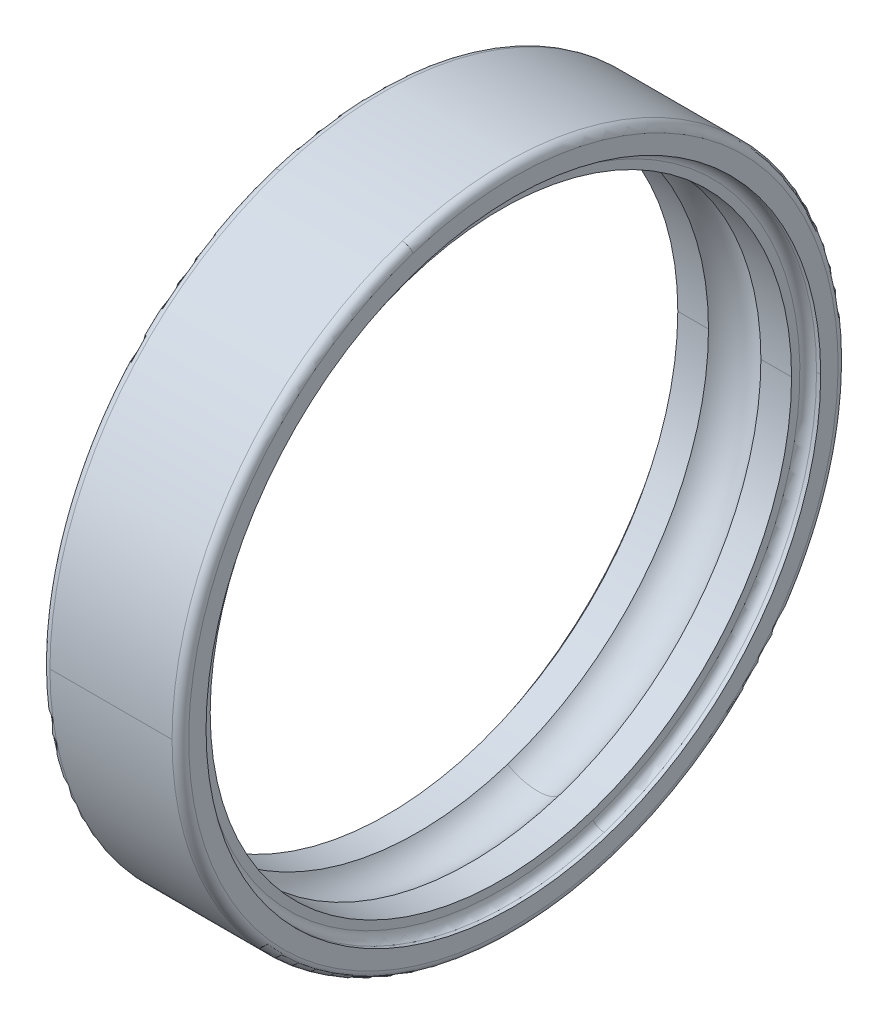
ISO-10303-21;
HEADER;
FILE_DESCRIPTION(('STEP AP214'),'2;1');
FILE_NAME('part.step','',(''),(''),'','','');
FILE_SCHEMA(('AUTOMOTIVE_DESIGN { 1 0 10303 214 1 1 1 1 }'));
ENDSEC;
DATA;
#1=APPLICATION_CONTEXT('core data for automotive mechanical design processes');
#2=APPLICATION_PROTOCOL_DEFINITION('international standard','automotive_design',2000,#1);
#3=PRODUCT_CONTEXT('',#1,'mechanical');
#4=PRODUCT('Part','Part','',(#3));
#5=PRODUCT_RELATED_PRODUCT_CATEGORY('part','',(#4));
#6=PRODUCT_DEFINITION_FORMATION('','',#4);
#7=PRODUCT_DEFINITION_CONTEXT('part definition',#1,'design');
#8=PRODUCT_DEFINITION('design','',#6,#7);
#9=PRODUCT_DEFINITION_SHAPE('','',#8);
#10=(LENGTH_UNIT() NAMED_UNIT(*) SI_UNIT(.MILLI.,.METRE.));
#11=(NAMED_UNIT(*) PLANE_ANGLE_UNIT() SI_UNIT($,.RADIAN.));
#12=(NAMED_UNIT(*) SI_UNIT($,.STERADIAN.) SOLID_ANGLE_UNIT());
#13=UNCERTAINTY_MEASURE_WITH_UNIT(LENGTH_MEASURE(1.E-05),#10,'distance_accuracy_value','');
#14=(GEOMETRIC_REPRESENTATION_CONTEXT(3) GLOBAL_UNCERTAINTY_ASSIGNED_CONTEXT((#13)) GLOBAL_UNIT_ASSIGNED_CONTEXT((#10,
#11,#12)) REPRESENTATION_CONTEXT('',''));
#15=CARTESIAN_POINT('',(0.,0.,0.));
#16=DIRECTION('',(0.,0.,1.));
#17=DIRECTION('',(1.,0.,0.));
#18=AXIS2_PLACEMENT_3D('',#15,#16,#17);
#19=CARTESIAN_POINT('',(0.299999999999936,0.,0.));
#20=DIRECTION('',(1.,0.,0.));
#21=DIRECTION('',(0.,-0.309016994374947,0.951056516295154));
#22=AXIS2_PLACEMENT_3D('',#19,#20,#21);
#23=TOROIDAL_SURFACE('',#22,11.7,0.299999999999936);
#24=CARTESIAN_POINT('',(0.299999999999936,-11.1273612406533,-3.61549883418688));
#25=DIRECTION('',(0.,0.309016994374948,-0.951056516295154));
#26=DIRECTION('',(2.11682523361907E-13,-0.951056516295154,-0.309016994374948));
#27=AXIS2_PLACEMENT_3D('',#24,#25,#26);
#28=CIRCLE('',#27,0.299999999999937);
#29=CARTESIAN_POINT('',(0.3,-11.4126781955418,-3.70820393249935));
#30=VERTEX_POINT('',#29);
#31=CARTESIAN_POINT('',(0.,-11.1273612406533,-3.61549883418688));
#32=VERTEX_POINT('',#31);
#33=EDGE_CURVE('E11',#30,#32,#28,.T.);
#34=ORIENTED_EDGE('',*,*,#33,.T.);
#35=CARTESIAN_POINT('',(0.,-11.1273612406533,-3.61549883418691));
#36=CARTESIAN_POINT('',(0.,-11.0682065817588,-3.79757129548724));
#37=CARTESIAN_POINT('',(0.,-11.0045757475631,-3.97818899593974));
#38=CARTESIAN_POINT('',(0.,-10.8685317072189,-4.33608609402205));
#39=CARTESIAN_POINT('',(0.,-10.7961185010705,-4.51336549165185));
#40=CARTESIAN_POINT('',(0.,-10.6426796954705,-4.86415720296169));
#41=CARTESIAN_POINT('',(0.,-10.561654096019,-5.03766951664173));
#42=CARTESIAN_POINT('',(0.,-10.3911868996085,-5.38050950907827));
#43=CARTESIAN_POINT('',(0.,-10.3017453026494,-5.54983718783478));
#44=CARTESIAN_POINT('',(0.,-10.114661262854,-5.88389986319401));
#45=CARTESIAN_POINT('',(0.,-10.0170188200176,-6.04863485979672));
#46=CARTESIAN_POINT('',(0.,-9.81376840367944,-6.37311534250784));
#47=CARTESIAN_POINT('',(0.,-9.70816043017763,-6.53286082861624));
#48=CARTESIAN_POINT('',(0.,-9.48923334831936,-6.84697744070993));
#49=CARTESIAN_POINT('',(0.,-9.3759142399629,-7.00134856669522));
#50=CARTESIAN_POINT('',(0.,-9.14183789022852,-7.30434456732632));
#51=CARTESIAN_POINT('',(0.,-9.02108064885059,-7.45296944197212));
#52=CARTESIAN_POINT('',(0.,-8.7724189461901,-7.74411488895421));
#53=CARTESIAN_POINT('',(0.,-8.64451448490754,-7.88663546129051));
#54=CARTESIAN_POINT('',(0.,-8.38186647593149,-8.16522895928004));
#55=CARTESIAN_POINT('',(0.,-8.247122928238,-8.30130188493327));
#56=CARTESIAN_POINT('',(0.,-7.97112135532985,-8.56667227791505));
#57=CARTESIAN_POINT('',(0.,-7.82986333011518,-8.6959697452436));
#58=CARTESIAN_POINT('',(0.,-7.54117310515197,-8.94747773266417));
#59=CARTESIAN_POINT('',(0.,-7.39374090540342,-9.06968825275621));
#60=CARTESIAN_POINT('',(0.,-7.09305750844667,-9.30672792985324));
#61=CARTESIAN_POINT('',(0.,-6.93980631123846,-9.42155708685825));
#62=CARTESIAN_POINT('',(0.,-6.62785411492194,-9.64355740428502));
#63=CARTESIAN_POINT('',(0.,-6.46915311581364,-9.75072856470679));
#64=CARTESIAN_POINT('',(0.,-6.14668364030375,-9.95715470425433));
#65=CARTESIAN_POINT('',(0.,-5.98291516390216,-10.0564096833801));
#66=CARTESIAN_POINT('',(0.,-5.65070526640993,-10.2467643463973));
#67=CARTESIAN_POINT('',(0.,-5.4822638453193,-10.3378640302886));
#68=CARTESIAN_POINT('',(0.,-5.14111384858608,-10.5116886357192));
#69=CARTESIAN_POINT('',(0.,-4.96840527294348,-10.5944135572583));
#70=CARTESIAN_POINT('',(0.,-4.61913703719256,-10.7512893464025));
#71=CARTESIAN_POINT('',(0.,-4.44257737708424,-10.8254402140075));
#72=CARTESIAN_POINT('',(0.,-4.08603232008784,-10.9649892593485));
#73=CARTESIAN_POINT('',(0.,-3.90604692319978,-11.0303874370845));
#74=CARTESIAN_POINT('',(0.,-3.54308399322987,-11.1522735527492));
#75=CARTESIAN_POINT('',(0.,-3.36010646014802,-11.2087614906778));
#76=CARTESIAN_POINT('',(0.,-2.9916000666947,-11.3126910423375));
#77=CARTESIAN_POINT('',(0.,-2.80607120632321,-11.3601326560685));
#78=CARTESIAN_POINT('',(0.,-2.43290911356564,-11.4458552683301));
#79=CARTESIAN_POINT('',(0.,-2.24527588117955,-11.4841362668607));
#80=CARTESIAN_POINT('',(0.,-1.86835706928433,-11.5514454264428));
#81=CARTESIAN_POINT('',(0.,-1.67907148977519,-11.5804735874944));
#82=CARTESIAN_POINT('',(0.,-1.29930398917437,-11.6292071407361));
#83=CARTESIAN_POINT('',(0.,-1.10882206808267,-11.6489125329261));
#84=CARTESIAN_POINT('',(0.,-0.727120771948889,-11.678953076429));
#85=CARTESIAN_POINT('',(0.,-0.535901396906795,-11.6892882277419));
#86=CARTESIAN_POINT('',(0.,-0.153185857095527,-11.7005633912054));
#87=CARTESIAN_POINT('',(0.,0.0383103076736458,-11.7015034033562));
#88=CARTESIAN_POINT('',(0.,0.421118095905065,-11.6939860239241));
#89=CARTESIAN_POINT('',(0.,0.612429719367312,-11.6855286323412));
#90=CARTESIAN_POINT('',(0.,0.994407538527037,-11.6592368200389));
#91=CARTESIAN_POINT('',(0.,1.18507373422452,-11.6414023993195));
#92=CARTESIAN_POINT('',(0.,1.56530136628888,-11.5963994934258));
#93=CARTESIAN_POINT('',(0.,1.75486280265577,-11.5692310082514));
#94=CARTESIAN_POINT('',(0.,2.13242424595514,-11.5056254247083));
#95=CARTESIAN_POINT('',(0.,2.32042425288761,-11.4691883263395));
#96=CARTESIAN_POINT('',(0.,2.69440992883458,-11.3871332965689));
#97=CARTESIAN_POINT('',(0.,2.88039559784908,-11.3415153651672));
#98=CARTESIAN_POINT('',(0.,3.24990454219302,-11.2412085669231));
#99=CARTESIAN_POINT('',(0.,3.43342781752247,-11.1865197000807));
#100=CARTESIAN_POINT('',(0.,3.7975698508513,-11.0682027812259));
#101=CARTESIAN_POINT('',(0.,3.97818860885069,-11.0045747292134));
#102=CARTESIAN_POINT('',(0.,4.33608648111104,-10.8685327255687));
#103=CARTESIAN_POINT('',(0.,4.51336559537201,-10.7961187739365));
#104=CARTESIAN_POINT('',(0.,4.86415709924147,-10.6426794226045));
#105=CARTESIAN_POINT('',(0.,5.03766948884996,-10.5616540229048));
#106=CARTESIAN_POINT('',(0.,5.38050953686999,-10.3911869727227));
#107=CARTESIAN_POINT('',(0.,5.54983719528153,-10.3017453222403));
#108=CARTESIAN_POINT('',(0.,5.8838998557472,-10.1146612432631));
#109=CARTESIAN_POINT('',(0.,6.04863485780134,-10.0170188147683));
#110=CARTESIAN_POINT('',(0.,6.37311534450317,-9.81376840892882));
#111=CARTESIAN_POINT('',(0.,6.53286082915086,-9.70816043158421));
#112=CARTESIAN_POINT('',(0.,6.84697744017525,-9.48923334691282));
#113=CARTESIAN_POINT('',(0.,7.00134856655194,-9.37591423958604));
#114=CARTESIAN_POINT('',(0.,7.30434456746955,-9.14183789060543));
#115=CARTESIAN_POINT('',(0.,7.45296944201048,-9.0210806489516));
#116=CARTESIAN_POINT('',(0.,7.7441148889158,-8.77241894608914));
#117=CARTESIAN_POINT('',(0.,7.8866354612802,-8.6445144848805));
#118=CARTESIAN_POINT('',(0.,8.1652289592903,-8.38186647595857));
#119=CARTESIAN_POINT('',(0.,8.30130188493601,-8.24712292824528));
#120=CARTESIAN_POINT('',(0.,8.56667227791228,-7.97112135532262));
#121=CARTESIAN_POINT('',(0.,8.69596974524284,-7.82986333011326));
#122=CARTESIAN_POINT('',(0.,8.94747773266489,-7.54117310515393));
#123=CARTESIAN_POINT('',(0.,9.06968825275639,-7.39374090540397));
#124=CARTESIAN_POINT('',(0.,9.30672792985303,-7.09305750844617));
#125=CARTESIAN_POINT('',(0.,9.42155708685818,-6.93980631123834));
#126=CARTESIAN_POINT('',(0.,9.64355740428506,-6.62785411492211));
#127=CARTESIAN_POINT('',(0.,9.75072856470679,-6.4691531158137));
#128=CARTESIAN_POINT('',(0.,9.9571547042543,-6.14668364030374));
#129=CARTESIAN_POINT('',(0.,10.0564096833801,-5.98291516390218));
#130=CARTESIAN_POINT('',(0.,10.2467643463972,-5.65070526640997));
#131=CARTESIAN_POINT('',(0.,10.3378640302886,-5.48226384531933));
#132=CARTESIAN_POINT('',(0.,10.5116886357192,-5.1411138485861));
#133=CARTESIAN_POINT('',(0.,10.5944135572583,-4.96840527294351));
#134=CARTESIAN_POINT('',(0.,10.7512893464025,-4.61913703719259));
#135=CARTESIAN_POINT('',(0.,10.8254402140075,-4.44257737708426));
#136=CARTESIAN_POINT('',(0.,10.9649892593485,-4.08603232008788));
#137=CARTESIAN_POINT('',(0.,11.0303874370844,-3.90604692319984));
#138=CARTESIAN_POINT('',(0.,11.1522735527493,-3.54308399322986));
#139=CARTESIAN_POINT('',(0.,11.2087614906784,-3.36010646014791));
#140=CARTESIAN_POINT('',(0.,11.312691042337,-2.99160006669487));
#141=CARTESIAN_POINT('',(0.,11.3601326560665,-2.80607120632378));
#142=CARTESIAN_POINT('',(0.,11.4458552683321,-2.43290911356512));
#143=CARTESIAN_POINT('',(0.,11.4841362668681,-2.24527588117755));
#144=CARTESIAN_POINT('',(0.,11.5514454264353,-1.86835706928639));
#145=CARTESIAN_POINT('',(0.,11.5804735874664,-1.67907148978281));
#146=CARTESIAN_POINT('',(0.,11.629207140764,-1.29930398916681));
#147=CARTESIAN_POINT('',(0.,11.6489125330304,-1.1088220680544));
#148=CARTESIAN_POINT('',(0.,11.6789530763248,-0.727120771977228));
#149=CARTESIAN_POINT('',(0.,11.6892882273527,-0.535901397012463));
#150=CARTESIAN_POINT('',(0.,11.7005633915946,-0.153185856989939));
#151=CARTESIAN_POINT('',(0.,11.7015034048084,0.038310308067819));
#152=CARTESIAN_POINT('',(0.,11.6939860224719,0.421118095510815));
#153=CARTESIAN_POINT('',(0.,11.6855286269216,0.612429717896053));
#154=CARTESIAN_POINT('',(0.,11.6592368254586,0.994407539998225));
#155=CARTESIAN_POINT('',(0.,11.641402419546,1.18507373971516));
#156=CARTESIAN_POINT('',(0.,11.5963994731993,1.56530136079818));
#157=CARTESIAN_POINT('',(0.,11.5692309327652,1.75486278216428));
#158=CARTESIAN_POINT('',(0.,11.5056255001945,2.13242426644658));
#159=CARTESIAN_POINT('',(0.,11.4691886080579,2.32042432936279));
#160=CARTESIAN_POINT('',(0.,11.3871330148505,2.69440985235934));
#161=CARTESIAN_POINT('',(0.,11.3415143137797,2.88039531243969));
#162=CARTESIAN_POINT('',(0.,11.2412096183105,3.24990482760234));
#163=CARTESIAN_POINT('',(0.,11.1865236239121,3.43342888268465));
#164=CARTESIAN_POINT('',(0.,11.1273612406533,3.61549883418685));
#165=B_SPLINE_CURVE_WITH_KNOTS('',3,(#35,#36,#37,#38,#39,#40,#41,#42,#43,#44,#45,#46,#47,#48,
#49,#50,#51,#52,#53,#54,#55,#56,#57,#58,#59,#60,#61,#62,#63,#64,#65,#66,#67,#68,#69,#70,#71,#72,
#73,#74,#75,#76,#77,#78,#79,#80,#81,#82,#83,#84,#85,#86,#87,#88,#89,#90,#91,#92,#93,#94,#95,#96,
#97,#98,#99,#100,#101,#102,#103,#104,#105,#106,#107,#108,#109,#110,#111,#112,#113,#114,#115,
#116,#117,#118,#119,#120,#121,#122,#123,#124,#125,#126,#127,#128,#129,#130,#131,#132,#133,#134,
#135,#136,#137,#138,#139,#140,#141,#142,#143,#144,#145,#146,#147,#148,#149,#150,#151,#152,#153,
#154,#155,#156,#157,#158,#159,#160,#161,#162,#163,#164),.UNSPECIFIED.,.F.,.F.,(4,2,2,2,2,2,2,2,
2,2,2,2,2,2,2,2,2,2,2,2,2,2,2,2,2,2,2,2,2,2,2,2,2,2,2,2,2,2,2,2,2,2,2,2,2,2,2,2,2,2,2,2,2,2,2,2,
2,2,2,2,2,2,2,2,4),(0.,0.574264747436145,1.14852949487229,1.72279424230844,2.29705898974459,
2.87132373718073,3.44558848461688,4.01985323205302,4.59411797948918,5.16838272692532,
5.74264747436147,6.31691222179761,6.89117696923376,7.4654417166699,8.03970646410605,
8.6139712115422,9.18823595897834,9.76250070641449,10.3367654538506,10.9110302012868,
11.4852949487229,12.0595596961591,12.6338244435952,13.2080891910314,13.7823539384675,
14.3566186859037,14.9308834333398,15.505148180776,16.0794129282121,16.6536776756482,
17.2279424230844,17.8022071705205,18.3764719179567,18.9507366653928,19.525001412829,
20.0992661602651,20.6735309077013,21.2477956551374,21.8220604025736,22.3963251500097,
22.9705898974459,23.544854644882,24.1191193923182,24.6933841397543,25.2676488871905,
25.8419136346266,26.4161783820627,26.9904431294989,27.564707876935,28.1389726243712,
28.7132373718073,29.2875021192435,29.8617668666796,30.4360316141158,31.0102963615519,
31.5845611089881,32.1588258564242,32.7330906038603,33.3073553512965,33.8816200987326,
34.4558848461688,35.0301495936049,35.6044143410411,36.1786790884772,36.7529438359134),.UNSPECIFIED.);
#166=CARTESIAN_POINT('',(0.,11.1273612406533,3.61549883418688));
#167=VERTEX_POINT('',#166);
#168=EDGE_CURVE('E26',#32,#167,#165,.T.);
#169=ORIENTED_EDGE('',*,*,#168,.T.);
#170=CARTESIAN_POINT('',(0.299999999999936,11.1273612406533,3.61549883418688));
#171=DIRECTION('',(0.,-0.309016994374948,0.951056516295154));
#172=DIRECTION('',(2.11682523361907E-13,0.951056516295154,0.309016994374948));
#173=AXIS2_PLACEMENT_3D('',#170,#171,#172);
#174=CIRCLE('',#173,0.299999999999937);
#175=CARTESIAN_POINT('',(0.3,11.4126781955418,3.70820393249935));
#176=VERTEX_POINT('',#175);
#177=EDGE_CURVE('E529',#176,#167,#174,.T.);
#178=ORIENTED_EDGE('',*,*,#177,.F.);
#179=CARTESIAN_POINT('',(0.3,0.,0.));
#180=DIRECTION('',(1.,0.,0.));
#181=DIRECTION('',(0.,0.,-1.));
#182=AXIS2_PLACEMENT_3D('',#179,#180,#181);
#183=CIRCLE('',#182,12.);
#184=CARTESIAN_POINT('',(0.3,0.,-12.));
#185=VERTEX_POINT('',#184);
#186=EDGE_CURVE('E524',#185,#176,#183,.T.);
#187=ORIENTED_EDGE('',*,*,#186,.F.);
#188=CARTESIAN_POINT('',(0.3,0.,0.));
#189=DIRECTION('',(1.,0.,0.));
#190=DIRECTION('',(0.,0.,-1.));
#191=AXIS2_PLACEMENT_3D('',#188,#189,#190);
#192=CIRCLE('',#191,12.);
#193=EDGE_CURVE('E519',#30,#185,#192,.T.);
#194=ORIENTED_EDGE('',*,*,#193,.F.);
#195=EDGE_LOOP('',(#34,#169,#178,#187,#194));
#196=FACE_BOUND('',#195,.T.);
#197=ADVANCED_FACE('F17',(#196),#23,.T.);
#198=CARTESIAN_POINT('',(50.,0.,0.));
#199=DIRECTION('',(1.,0.,0.));
#200=DIRECTION('',(0.,1.,0.));
#201=AXIS2_PLACEMENT_3D('',#198,#199,#200);
#202=CYLINDRICAL_SURFACE('',#201,12.);
#203=DIRECTION('',(1.,0.,0.));
#204=VECTOR('',#203,1.);
#205=CARTESIAN_POINT('',(0.299999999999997,0.,12.));
#206=LINE('',#205,#204);
#207=CARTESIAN_POINT('',(0.299999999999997,0.,12.));
#208=VERTEX_POINT('',#207);
#209=CARTESIAN_POINT('',(4.7,0.,12.));
#210=VERTEX_POINT('',#209);
#211=EDGE_CURVE('E514',#208,#210,#206,.T.);
#212=ORIENTED_EDGE('',*,*,#211,.F.);
#213=CARTESIAN_POINT('',(0.3,0.,0.));
#214=DIRECTION('',(1.,0.,0.));
#215=DIRECTION('',(0.,0.,-1.));
#216=AXIS2_PLACEMENT_3D('',#213,#214,#215);
#217=CIRCLE('',#216,12.);
#218=EDGE_CURVE('E509',#208,#30,#217,.T.);
#219=ORIENTED_EDGE('',*,*,#218,.T.);
#220=ORIENTED_EDGE('',*,*,#193,.T.);
#221=DIRECTION('',(1.,0.,0.));
#222=VECTOR('',#221,1.);
#223=CARTESIAN_POINT('',(0.299999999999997,0.,-12.));
#224=LINE('',#223,#222);
#225=CARTESIAN_POINT('',(4.7,0.,-12.));
#226=VERTEX_POINT('',#225);
#227=EDGE_CURVE('E505',#185,#226,#224,.T.);
#228=ORIENTED_EDGE('',*,*,#227,.T.);
#229=CARTESIAN_POINT('',(4.7,0.,0.));
#230=DIRECTION('',(1.,0.,0.));
#231=DIRECTION('',(0.,0.,-1.));
#232=AXIS2_PLACEMENT_3D('',#229,#230,#231);
#233=CIRCLE('',#232,12.);
#234=CARTESIAN_POINT('',(4.7,-11.4126781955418,-3.70820393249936));
#235=VERTEX_POINT('',#234);
#236=EDGE_CURVE('E500',#235,#226,#233,.T.);
#237=ORIENTED_EDGE('',*,*,#236,.F.);
#238=CARTESIAN_POINT('',(4.7,0.,0.));
#239=DIRECTION('',(1.,0.,0.));
#240=DIRECTION('',(0.,0.,-1.));
#241=AXIS2_PLACEMENT_3D('',#238,#239,#240);
#242=CIRCLE('',#241,12.);
#243=EDGE_CURVE('E495',#210,#235,#242,.T.);
#244=ORIENTED_EDGE('',*,*,#243,.F.);
#245=EDGE_LOOP('',(#212,#219,#220,#228,#237,#244));
#246=FACE_BOUND('',#245,.T.);
#247=ADVANCED_FACE('F550',(#246),#202,.T.);
#248=CARTESIAN_POINT('',(4.70000000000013,0.,0.));
#249=DIRECTION('',(1.,0.,0.));
#250=DIRECTION('',(0.,0.309016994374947,-0.951056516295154));
#251=AXIS2_PLACEMENT_3D('',#248,#249,#250);
#252=TOROIDAL_SURFACE('',#251,11.7000000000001,0.299999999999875);
#253=CARTESIAN_POINT('',(4.70000000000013,-11.1273612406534,-3.61549883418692));
#254=DIRECTION('',(0.,0.309016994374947,-0.951056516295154));
#255=DIRECTION('',(1.,0.,0.));
#256=AXIS2_PLACEMENT_3D('',#253,#254,#255);
#257=CIRCLE('',#256,0.299999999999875);
#258=CARTESIAN_POINT('',(5.00000000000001,-11.1273612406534,-3.61549883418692));
#259=VERTEX_POINT('',#258);
#260=EDGE_CURVE('E490',#259,#235,#257,.T.);
#261=ORIENTED_EDGE('',*,*,#260,.F.);
#262=CARTESIAN_POINT('',(5.,0.,0.));
#263=DIRECTION('',(1.,0.,0.));
#264=DIRECTION('',(0.,0.,-1.));
#265=AXIS2_PLACEMENT_3D('',#262,#263,#264);
#266=CIRCLE('',#265,11.7);
#267=CARTESIAN_POINT('',(5.00000000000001,11.1273612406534,3.61549883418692));
#268=VERTEX_POINT('',#267);
#269=EDGE_CURVE('E485',#268,#259,#266,.T.);
#270=ORIENTED_EDGE('',*,*,#269,.F.);
#271=CARTESIAN_POINT('',(4.70000000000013,11.1273612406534,3.61549883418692));
#272=DIRECTION('',(0.,-0.309016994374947,0.951056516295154));
#273=DIRECTION('',(1.,0.,0.));
#274=AXIS2_PLACEMENT_3D('',#271,#272,#273);
#275=CIRCLE('',#274,0.299999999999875);
#276=CARTESIAN_POINT('',(4.7,11.4126781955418,3.70820393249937));
#277=VERTEX_POINT('',#276);
#278=EDGE_CURVE('E481',#268,#277,#275,.T.);
#279=ORIENTED_EDGE('',*,*,#278,.T.);
#280=CARTESIAN_POINT('',(4.7,0.,0.));
#281=DIRECTION('',(1.,0.,0.));
#282=DIRECTION('',(0.,0.,-1.));
#283=AXIS2_PLACEMENT_3D('',#280,#281,#282);
#284=CIRCLE('',#283,12.);
#285=EDGE_CURVE('E476',#277,#210,#284,.T.);
#286=ORIENTED_EDGE('',*,*,#285,.T.);
#287=ORIENTED_EDGE('',*,*,#243,.T.);
#288=EDGE_LOOP('',(#261,#270,#279,#286,#287));
#289=FACE_BOUND('',#288,.T.);
#290=ADVANCED_FACE('F552',(#289),#252,.T.);
#291=CARTESIAN_POINT('',(50.,0.,0.));
#292=DIRECTION('',(1.,0.,0.));
#293=DIRECTION('',(0.,-1.,0.));
#294=AXIS2_PLACEMENT_3D('',#291,#292,#293);
#295=CYLINDRICAL_SURFACE('',#294,12.);
#296=ORIENTED_EDGE('',*,*,#211,.T.);
#297=ORIENTED_EDGE('',*,*,#285,.F.);
#298=CARTESIAN_POINT('',(4.7,0.,0.));
#299=DIRECTION('',(1.,0.,0.));
#300=DIRECTION('',(0.,0.,-1.));
#301=AXIS2_PLACEMENT_3D('',#298,#299,#300);
#302=CIRCLE('',#301,12.);
#303=EDGE_CURVE('E471',#226,#277,#302,.T.);
#304=ORIENTED_EDGE('',*,*,#303,.F.);
#305=ORIENTED_EDGE('',*,*,#227,.F.);
#306=ORIENTED_EDGE('',*,*,#186,.T.);
#307=CARTESIAN_POINT('',(0.3,0.,0.));
#308=DIRECTION('',(1.,0.,0.));
#309=DIRECTION('',(0.,0.,-1.));
#310=AXIS2_PLACEMENT_3D('',#307,#308,#309);
#311=CIRCLE('',#310,12.);
#312=EDGE_CURVE('E468',#176,#208,#311,.T.);
#313=ORIENTED_EDGE('',*,*,#312,.T.);
#314=EDGE_LOOP('',(#296,#297,#304,#305,#306,#313));
#315=FACE_BOUND('',#314,.T.);
#316=ADVANCED_FACE('F546',(#315),#295,.T.);
#317=CARTESIAN_POINT('',(0.299999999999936,0.,0.));
#318=DIRECTION('',(1.,0.,0.));
#319=DIRECTION('',(0.,0.309016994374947,-0.951056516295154));
#320=AXIS2_PLACEMENT_3D('',#317,#318,#319);
#321=TOROIDAL_SURFACE('',#320,11.7,0.299999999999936);
#322=ORIENTED_EDGE('',*,*,#33,.F.);
#323=ORIENTED_EDGE('',*,*,#218,.F.);
#324=ORIENTED_EDGE('',*,*,#312,.F.);
#325=ORIENTED_EDGE('',*,*,#177,.T.);
#326=CARTESIAN_POINT('',(0.,11.1273612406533,3.61549883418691));
#327=CARTESIAN_POINT('',(0.,11.0682065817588,3.79757129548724));
#328=CARTESIAN_POINT('',(0.,11.0045757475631,3.97818899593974));
#329=CARTESIAN_POINT('',(0.,10.8685317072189,4.33608609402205));
#330=CARTESIAN_POINT('',(0.,10.7961185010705,4.51336549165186));
#331=CARTESIAN_POINT('',(0.,10.6426796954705,4.8641572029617));
#332=CARTESIAN_POINT('',(0.,10.561654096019,5.03766951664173));
#333=CARTESIAN_POINT('',(0.,10.3911868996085,5.38050950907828));
#334=CARTESIAN_POINT('',(0.,10.3017453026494,5.54983718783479));
#335=CARTESIAN_POINT('',(0.,10.114661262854,5.88389986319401));
#336=CARTESIAN_POINT('',(0.,10.0170188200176,6.04863485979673));
#337=CARTESIAN_POINT('',(0.,9.81376840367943,6.37311534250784));
#338=CARTESIAN_POINT('',(0.,9.70816043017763,6.53286082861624));
#339=CARTESIAN_POINT('',(0.,9.48923334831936,6.84697744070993));
#340=CARTESIAN_POINT('',(0.,9.3759142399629,7.00134856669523));
#341=CARTESIAN_POINT('',(0.,9.14183789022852,7.30434456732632));
#342=CARTESIAN_POINT('',(0.,9.02108064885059,7.45296944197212));
#343=CARTESIAN_POINT('',(0.,8.7724189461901,7.74411488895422));
#344=CARTESIAN_POINT('',(0.,8.64451448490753,7.88663546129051));
#345=CARTESIAN_POINT('',(0.,8.38186647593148,8.16522895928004));
#346=CARTESIAN_POINT('',(0.,8.247122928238,8.30130188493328));
#347=CARTESIAN_POINT('',(0.,7.97112135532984,8.56667227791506));
#348=CARTESIAN_POINT('',(0.,7.82986333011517,8.6959697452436));
#349=CARTESIAN_POINT('',(0.,7.54117310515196,8.94747773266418));
#350=CARTESIAN_POINT('',(0.,7.39374090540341,9.06968825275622));
#351=CARTESIAN_POINT('',(0.,7.09305750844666,9.30672792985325));
#352=CARTESIAN_POINT('',(0.,6.93980631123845,9.42155708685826));
#353=CARTESIAN_POINT('',(0.,6.62785411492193,9.64355740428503));
#354=CARTESIAN_POINT('',(0.,6.46915311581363,9.7507285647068));
#355=CARTESIAN_POINT('',(0.,6.14668364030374,9.95715470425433));
#356=CARTESIAN_POINT('',(0.,5.98291516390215,10.0564096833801));
#357=CARTESIAN_POINT('',(0.,5.65070526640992,10.2467643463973));
#358=CARTESIAN_POINT('',(0.,5.48226384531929,10.3378640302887));
#359=CARTESIAN_POINT('',(0.,5.14111384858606,10.5116886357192));
#360=CARTESIAN_POINT('',(0.,4.96840527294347,10.5944135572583));
#361=CARTESIAN_POINT('',(0.,4.61913703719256,10.7512893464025));
#362=CARTESIAN_POINT('',(0.,4.44257737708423,10.8254402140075));
#363=CARTESIAN_POINT('',(0.,4.08603232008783,10.9649892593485));
#364=CARTESIAN_POINT('',(0.,3.90604692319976,11.0303874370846));
#365=CARTESIAN_POINT('',(0.,3.54308399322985,11.1522735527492));
#366=CARTESIAN_POINT('',(0.,3.36010646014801,11.2087614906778));
#367=CARTESIAN_POINT('',(0.,2.99160006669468,11.3126910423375));
#368=CARTESIAN_POINT('',(0.,2.8060712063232,11.3601326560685));
#369=CARTESIAN_POINT('',(0.,2.43290911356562,11.4458552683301));
#370=CARTESIAN_POINT('',(0.,2.24527588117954,11.4841362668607));
#371=CARTESIAN_POINT('',(0.,1.86835706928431,11.5514454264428));
#372=CARTESIAN_POINT('',(0.,1.67907148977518,11.5804735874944));
#373=CARTESIAN_POINT('',(0.,1.29930398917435,11.6292071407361));
#374=CARTESIAN_POINT('',(0.,1.10882206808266,11.6489125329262));
#375=CARTESIAN_POINT('',(0.,0.727120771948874,11.678953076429));
#376=CARTESIAN_POINT('',(0.,0.535901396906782,11.6892882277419));
#377=CARTESIAN_POINT('',(0.,0.153185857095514,11.7005633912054));
#378=CARTESIAN_POINT('',(0.,-0.038310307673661,11.7015034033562));
#379=CARTESIAN_POINT('',(0.,-0.421118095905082,11.6939860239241));
#380=CARTESIAN_POINT('',(0.,-0.612429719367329,11.6855286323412));
#381=CARTESIAN_POINT('',(0.,-0.994407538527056,11.6592368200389));
#382=CARTESIAN_POINT('',(0.,-1.18507373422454,11.6414023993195));
#383=CARTESIAN_POINT('',(0.,-1.56530136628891,11.5963994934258));
#384=CARTESIAN_POINT('',(0.,-1.75486280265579,11.5692310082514));
#385=CARTESIAN_POINT('',(0.,-2.13242424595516,11.5056254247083));
#386=CARTESIAN_POINT('',(0.,-2.32042425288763,11.4691883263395));
#387=CARTESIAN_POINT('',(0.,-2.6944099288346,11.3871332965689));
#388=CARTESIAN_POINT('',(0.,-2.8803955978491,11.3415153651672));
#389=CARTESIAN_POINT('',(0.,-3.24990454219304,11.241208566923));
#390=CARTESIAN_POINT('',(0.,-3.43342781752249,11.1865197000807));
#391=CARTESIAN_POINT('',(0.,-3.79756985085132,11.0682027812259));
#392=CARTESIAN_POINT('',(0.,-3.97818860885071,11.0045747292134));
#393=CARTESIAN_POINT('',(0.,-4.33608648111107,10.8685327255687));
#394=CARTESIAN_POINT('',(0.,-4.51336559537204,10.7961187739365));
#395=CARTESIAN_POINT('',(0.,-4.86415709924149,10.6426794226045));
#396=CARTESIAN_POINT('',(0.,-5.03766948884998,10.5616540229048));
#397=CARTESIAN_POINT('',(0.,-5.38050953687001,10.3911869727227));
#398=CARTESIAN_POINT('',(0.,-5.54983719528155,10.3017453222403));
#399=CARTESIAN_POINT('',(0.,-5.88389985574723,10.1146612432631));
#400=CARTESIAN_POINT('',(0.,-6.04863485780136,10.0170188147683));
#401=CARTESIAN_POINT('',(0.,-6.37311534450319,9.81376840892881));
#402=CARTESIAN_POINT('',(0.,-6.53286082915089,9.7081604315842));
#403=CARTESIAN_POINT('',(0.,-6.84697744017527,9.4892333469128));
#404=CARTESIAN_POINT('',(0.,-7.00134856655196,9.37591423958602));
#405=CARTESIAN_POINT('',(0.,-7.30434456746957,9.14183789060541));
#406=CARTESIAN_POINT('',(0.,-7.4529694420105,9.02108064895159));
#407=CARTESIAN_POINT('',(0.,-7.74411488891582,8.77241894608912));
#408=CARTESIAN_POINT('',(0.,-7.88663546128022,8.64451448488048));
#409=CARTESIAN_POINT('',(0.,-8.16522895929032,8.38186647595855));
#410=CARTESIAN_POINT('',(0.,-8.30130188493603,8.24712292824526));
#411=CARTESIAN_POINT('',(0.,-8.5666722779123,7.9711213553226));
#412=CARTESIAN_POINT('',(0.,-8.69596974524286,7.82986333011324));
#413=CARTESIAN_POINT('',(0.,-8.94747773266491,7.54117310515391));
#414=CARTESIAN_POINT('',(0.,-9.06968825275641,7.39374090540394));
#415=CARTESIAN_POINT('',(0.,-9.30672792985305,7.09305750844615));
#416=CARTESIAN_POINT('',(0.,-9.4215570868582,6.93980631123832));
#417=CARTESIAN_POINT('',(0.,-9.64355740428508,6.62785411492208));
#418=CARTESIAN_POINT('',(0.,-9.75072856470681,6.46915311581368));
#419=CARTESIAN_POINT('',(0.,-9.95715470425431,6.14668364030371));
#420=CARTESIAN_POINT('',(0.,-10.0564096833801,5.98291516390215));
#421=CARTESIAN_POINT('',(0.,-10.2467643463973,5.65070526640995));
#422=CARTESIAN_POINT('',(0.,-10.3378640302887,5.4822638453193));
#423=CARTESIAN_POINT('',(0.,-10.5116886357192,5.14111384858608));
#424=CARTESIAN_POINT('',(0.,-10.5944135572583,4.96840527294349));
#425=CARTESIAN_POINT('',(0.,-10.7512893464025,4.61913703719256));
#426=CARTESIAN_POINT('',(0.,-10.8254402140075,4.44257737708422));
#427=CARTESIAN_POINT('',(0.,-10.9649892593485,4.08603232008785));
#428=CARTESIAN_POINT('',(0.,-11.0303874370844,3.90604692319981));
#429=CARTESIAN_POINT('',(0.,-11.1522735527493,3.54308399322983));
#430=CARTESIAN_POINT('',(0.,-11.2087614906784,3.36010646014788));
#431=CARTESIAN_POINT('',(0.,-11.312691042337,2.99160006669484));
#432=CARTESIAN_POINT('',(0.,-11.3601326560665,2.80607120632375));
#433=CARTESIAN_POINT('',(0.,-11.4458552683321,2.43290911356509));
#434=CARTESIAN_POINT('',(0.,-11.4841362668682,2.24527588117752));
#435=CARTESIAN_POINT('',(0.,-11.5514454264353,1.86835706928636));
#436=CARTESIAN_POINT('',(0.,-11.5804735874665,1.67907148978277));
#437=CARTESIAN_POINT('',(0.,-11.629207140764,1.29930398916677));
#438=CARTESIAN_POINT('',(0.,-11.6489125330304,1.10882206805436));
#439=CARTESIAN_POINT('',(0.,-11.6789530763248,0.727120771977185));
#440=CARTESIAN_POINT('',(0.,-11.6892882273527,0.53590139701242));
#441=CARTESIAN_POINT('',(0.,-11.7005633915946,0.153185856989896));
#442=CARTESIAN_POINT('',(0.,-11.7015034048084,-0.0383103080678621));
#443=CARTESIAN_POINT('',(0.,-11.6939860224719,-0.421118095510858));
#444=CARTESIAN_POINT('',(0.,-11.6855286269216,-0.612429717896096));
#445=CARTESIAN_POINT('',(0.,-11.6592368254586,-0.994407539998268));
#446=CARTESIAN_POINT('',(0.,-11.641402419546,-1.1850737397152));
#447=CARTESIAN_POINT('',(0.,-11.5963994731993,-1.56530136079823));
#448=CARTESIAN_POINT('',(0.,-11.5692309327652,-1.75486278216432));
#449=CARTESIAN_POINT('',(0.,-11.5056255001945,-2.13242426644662));
#450=CARTESIAN_POINT('',(0.,-11.4691886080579,-2.32042432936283));
#451=CARTESIAN_POINT('',(0.,-11.3871330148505,-2.69440985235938));
#452=CARTESIAN_POINT('',(0.,-11.3415143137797,-2.88039531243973));
#453=CARTESIAN_POINT('',(0.,-11.2412096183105,-3.24990482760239));
#454=CARTESIAN_POINT('',(0.,-11.1865236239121,-3.43342888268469));
#455=CARTESIAN_POINT('',(0.,-11.1273612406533,-3.61549883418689));
#456=B_SPLINE_CURVE_WITH_KNOTS('',3,(#326,#327,#328,#329,#330,#331,#332,#333,#334,#335,#336,
#337,#338,#339,#340,#341,#342,#343,#344,#345,#346,#347,#348,#349,#350,#351,#352,#353,#354,#355,
#356,#357,#358,#359,#360,#361,#362,#363,#364,#365,#366,#367,#368,#369,#370,#371,#372,#373,#374,
#375,#376,#377,#378,#379,#380,#381,#382,#383,#384,#385,#386,#387,#388,#389,#390,#391,#392,#393,
#394,#395,#396,#397,#398,#399,#400,#401,#402,#403,#404,#405,#406,#407,#408,#409,#410,#411,#412,
#413,#414,#415,#416,#417,#418,#419,#420,#421,#422,#423,#424,#425,#426,#427,#428,#429,#430,#431,
#432,#433,#434,#435,#436,#437,#438,#439,#440,#441,#442,#443,#444,#445,#446,#447,#448,#449,#450,
#451,#452,#453,#454,#455),.UNSPECIFIED.,.F.,.F.,(4,2,2,2,2,2,2,2,2,2,2,2,2,2,2,2,2,2,2,2,2,2,2,
2,2,2,2,2,2,2,2,2,2,2,2,2,2,2,2,2,2,2,2,2,2,2,2,2,2,2,2,2,2,2,2,2,2,2,2,2,2,2,2,2,4),(0.,
0.574264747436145,1.14852949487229,1.72279424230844,2.29705898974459,2.87132373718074,
3.44558848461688,4.01985323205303,4.59411797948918,5.16838272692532,5.74264747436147,
6.31691222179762,6.89117696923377,7.46544171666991,8.03970646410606,8.61397121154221,
9.18823595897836,9.7625007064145,10.3367654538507,10.9110302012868,11.4852949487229,
12.0595596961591,12.6338244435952,13.2080891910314,13.7823539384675,14.3566186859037,
14.9308834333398,15.505148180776,16.0794129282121,16.6536776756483,17.2279424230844,
17.8022071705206,18.3764719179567,18.9507366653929,19.525001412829,20.0992661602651,
20.6735309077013,21.2477956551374,21.8220604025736,22.3963251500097,22.9705898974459,
23.544854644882,24.1191193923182,24.6933841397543,25.2676488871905,25.8419136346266,
26.4161783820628,26.9904431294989,27.5647078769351,28.1389726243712,28.7132373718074,
29.2875021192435,29.8617668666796,30.4360316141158,31.0102963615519,31.5845611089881,
32.1588258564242,32.7330906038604,33.3073553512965,33.8816200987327,34.4558848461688,
35.030149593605,35.6044143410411,36.1786790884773,36.7529438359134),.UNSPECIFIED.);
#457=EDGE_CURVE('E454',#167,#32,#456,.T.);
#458=ORIENTED_EDGE('',*,*,#457,.T.);
#459=EDGE_LOOP('',(#322,#323,#324,#325,#458));
#460=FACE_BOUND('',#459,.T.);
#461=ADVANCED_FACE('F434',(#460),#321,.T.);
#462=CARTESIAN_POINT('',(0.,11.7,0.));
#463=DIRECTION('',(-1.,0.,0.));
#464=DIRECTION('',(0.,0.,1.));
#465=AXIS2_PLACEMENT_3D('',#462,#463,#464);
#466=PLANE('',#465);
#467=CARTESIAN_POINT('',(0.,0.,0.));
#468=DIRECTION('',(1.,0.,0.));
#469=DIRECTION('',(0.,0.,-1.));
#470=AXIS2_PLACEMENT_3D('',#467,#468,#469);
#471=CIRCLE('',#470,11.075);
#472=CARTESIAN_POINT('',(0.,0.,-11.075));
#473=VERTEX_POINT('',#472);
#474=CARTESIAN_POINT('',(0.,0.,11.075));
#475=VERTEX_POINT('',#474);
#476=EDGE_CURVE('E450',#473,#475,#471,.T.);
#477=ORIENTED_EDGE('',*,*,#476,.T.);
#478=CARTESIAN_POINT('',(0.,0.,0.));
#479=DIRECTION('',(1.,0.,0.));
#480=DIRECTION('',(0.,0.,-1.));
#481=AXIS2_PLACEMENT_3D('',#478,#479,#480);
#482=CIRCLE('',#481,11.075);
#483=EDGE_CURVE('E415',#475,#473,#482,.T.);
#484=ORIENTED_EDGE('',*,*,#483,.T.);
#485=EDGE_LOOP('',(#477,#484));
#486=FACE_BOUND('',#485,.T.);
#487=ORIENTED_EDGE('',*,*,#168,.F.);
#488=ORIENTED_EDGE('',*,*,#457,.F.);
#489=EDGE_LOOP('',(#487,#488));
#490=FACE_BOUND('',#489,.T.);
#491=ADVANCED_FACE('F423',(#486,#490),#466,.T.);
#492=CARTESIAN_POINT('',(50.,0.,0.));
#493=DIRECTION('',(1.,0.,0.));
#494=DIRECTION('',(0.,1.,0.));
#495=AXIS2_PLACEMENT_3D('',#492,#493,#494);
#496=CYLINDRICAL_SURFACE('',#495,11.075);
#497=DIRECTION('',(1.,0.,0.));
#498=VECTOR('',#497,1.);
#499=CARTESIAN_POINT('',(0.,0.,11.075));
#500=LINE('',#499,#498);
#501=CARTESIAN_POINT('',(0.149999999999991,0.,11.075));
#502=VERTEX_POINT('',#501);
#503=EDGE_CURVE('E411',#475,#502,#500,.T.);
#504=ORIENTED_EDGE('',*,*,#503,.T.);
#505=CARTESIAN_POINT('',(0.14999999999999,0.,0.));
#506=DIRECTION('',(1.,0.,0.));
#507=DIRECTION('',(0.,0.,-1.));
#508=AXIS2_PLACEMENT_3D('',#505,#506,#507);
#509=CIRCLE('',#508,11.075);
#510=CARTESIAN_POINT('',(0.14999999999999,-10.5329509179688,-3.42236321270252));
#511=VERTEX_POINT('',#510);
#512=EDGE_CURVE('E407',#502,#511,#509,.T.);
#513=ORIENTED_EDGE('',*,*,#512,.T.);
#514=CARTESIAN_POINT('',(0.14999999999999,0.,0.));
#515=DIRECTION('',(1.,0.,0.));
#516=DIRECTION('',(0.,0.,-1.));
#517=AXIS2_PLACEMENT_3D('',#514,#515,#516);
#518=CIRCLE('',#517,11.075);
#519=CARTESIAN_POINT('',(0.14999999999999,0.,-11.075));
#520=VERTEX_POINT('',#519);
#521=EDGE_CURVE('E403',#511,#520,#518,.T.);
#522=ORIENTED_EDGE('',*,*,#521,.T.);
#523=DIRECTION('',(1.,0.,0.));
#524=VECTOR('',#523,1.);
#525=CARTESIAN_POINT('',(0.,0.,-11.075));
#526=LINE('',#525,#524);
#527=EDGE_CURVE('E398',#473,#520,#526,.T.);
#528=ORIENTED_EDGE('',*,*,#527,.F.);
#529=ORIENTED_EDGE('',*,*,#483,.F.);
#530=EDGE_LOOP('',(#504,#513,#522,#528,#529));
#531=FACE_BOUND('',#530,.T.);
#532=ADVANCED_FACE('F433',(#531),#496,.F.);
#533=CARTESIAN_POINT('',(50.,0.,0.));
#534=DIRECTION('',(1.,0.,0.));
#535=DIRECTION('',(0.,-1.,0.));
#536=AXIS2_PLACEMENT_3D('',#533,#534,#535);
#537=CYLINDRICAL_SURFACE('',#536,11.075);
#538=ORIENTED_EDGE('',*,*,#503,.F.);
#539=ORIENTED_EDGE('',*,*,#476,.F.);
#540=ORIENTED_EDGE('',*,*,#527,.T.);
#541=CARTESIAN_POINT('',(0.14999999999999,0.,0.));
#542=DIRECTION('',(1.,0.,0.));
#543=DIRECTION('',(0.,0.,-1.));
#544=AXIS2_PLACEMENT_3D('',#541,#542,#543);
#545=CIRCLE('',#544,11.075);
#546=CARTESIAN_POINT('',(0.14999999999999,10.5329509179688,3.42236321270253));
#547=VERTEX_POINT('',#546);
#548=EDGE_CURVE('E394',#520,#547,#545,.T.);
#549=ORIENTED_EDGE('',*,*,#548,.T.);
#550=CARTESIAN_POINT('',(0.14999999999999,0.,0.));
#551=DIRECTION('',(1.,0.,0.));
#552=DIRECTION('',(0.,0.,-1.));
#553=AXIS2_PLACEMENT_3D('',#550,#551,#552);
#554=CIRCLE('',#553,11.075);
#555=EDGE_CURVE('E389',#547,#502,#554,.T.);
#556=ORIENTED_EDGE('',*,*,#555,.T.);
#557=EDGE_LOOP('',(#538,#539,#540,#549,#556));
#558=FACE_BOUND('',#557,.T.);
#559=ADVANCED_FACE('F609',(#558),#537,.F.);
#560=CARTESIAN_POINT('',(0.150000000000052,0.,0.));
#561=DIRECTION('',(1.,0.,0.));
#562=DIRECTION('',(0.,0.309016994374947,-0.951056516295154));
#563=AXIS2_PLACEMENT_3D('',#560,#561,#562);
#564=TOROIDAL_SURFACE('',#563,10.775,0.299999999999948);
#565=CARTESIAN_POINT('',(0.150000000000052,-10.2476339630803,-3.32965811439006));
#566=DIRECTION('',(0.,0.309016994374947,-0.951056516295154));
#567=DIRECTION('',(1.,0.,0.));
#568=AXIS2_PLACEMENT_3D('',#565,#566,#567);
#569=CIRCLE('',#568,0.299999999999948);
#570=CARTESIAN_POINT('',(0.45,-10.2476339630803,-3.32965811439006));
#571=VERTEX_POINT('',#570);
#572=EDGE_CURVE('E366',#571,#511,#569,.T.);
#573=ORIENTED_EDGE('',*,*,#572,.T.);
#574=ORIENTED_EDGE('',*,*,#512,.F.);
#575=ORIENTED_EDGE('',*,*,#555,.F.);
#576=CARTESIAN_POINT('',(0.150000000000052,10.2476339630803,3.32965811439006));
#577=DIRECTION('',(0.,-0.309016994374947,0.951056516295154));
#578=DIRECTION('',(1.,0.,0.));
#579=AXIS2_PLACEMENT_3D('',#576,#577,#578);
#580=CIRCLE('',#579,0.299999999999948);
#581=CARTESIAN_POINT('',(0.45,10.2476339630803,3.32965811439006));
#582=VERTEX_POINT('',#581);
#583=EDGE_CURVE('E360',#582,#547,#580,.T.);
#584=ORIENTED_EDGE('',*,*,#583,.F.);
#585=CARTESIAN_POINT('',(0.45,10.2476339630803,3.32965811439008));
#586=CARTESIAN_POINT('',(0.45,10.1931560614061,3.49733595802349));
#587=CARTESIAN_POINT('',(0.45,10.1345558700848,3.66367405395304));
#588=CARTESIAN_POINT('',(0.45,10.0092674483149,3.99327586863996));
#589=CARTESIAN_POINT('',(0.45,9.94257921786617,4.15653958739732));
#590=CARTESIAN_POINT('',(0.45,9.80127125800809,4.4795977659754));
#591=CARTESIAN_POINT('',(0.45,9.72665152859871,4.63939222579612));
#592=CARTESIAN_POINT('',(0.45,9.5696614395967,4.95512734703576));
#593=CARTESIAN_POINT('',(0.45,9.48729108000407,5.11106800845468));
#594=CARTESIAN_POINT('',(0.45,9.31499787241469,5.41871974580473));
#595=CARTESIAN_POINT('',(0.45,9.22507502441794,5.57043082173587));
#596=CARTESIAN_POINT('',(0.45,9.03789355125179,5.86925793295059));
#597=CARTESIAN_POINT('',(0.45,8.94063492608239,6.01637396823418));
#598=CARTESIAN_POINT('',(0.45,8.73901618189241,6.30565657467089));
#599=CARTESIAN_POINT('',(0.45,8.63465606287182,6.44782314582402));
#600=CARTESIAN_POINT('',(0.45,8.41908574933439,6.72686433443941));
#601=CARTESIAN_POINT('',(0.45,8.30787555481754,6.86373895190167));
#602=CARTESIAN_POINT('',(0.45,8.07887300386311,7.13186648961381));
#603=CARTESIAN_POINT('',(0.45,7.96108064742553,7.26311940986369));
#604=CARTESIAN_POINT('',(0.45,7.71919754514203,7.51968735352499));
#605=CARTESIAN_POINT('',(0.45,7.59510679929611,7.64500237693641));
#606=CARTESIAN_POINT('',(0.45,7.34092586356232,7.88939263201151));
#607=CARTESIAN_POINT('',(0.45,7.21083567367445,8.00846786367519));
#608=CARTESIAN_POINT('',(0.45,6.94496924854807,8.24009167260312));
#609=CARTESIAN_POINT('',(0.45,6.80919301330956,8.35264024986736));
#610=CARTESIAN_POINT('',(0.45,6.53228159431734,8.57093961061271));
#611=CARTESIAN_POINT('',(0.45,6.39114641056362,8.67669039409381));
#612=CARTESIAN_POINT('',(0.45,6.10385710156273,8.8811394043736));
#613=CARTESIAN_POINT('',(0.45,5.95770297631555,8.97983763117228));
#614=CARTESIAN_POINT('',(0.45,5.66072788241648,9.16994375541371));
#615=CARTESIAN_POINT('',(0.45,5.50990691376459,9.26135165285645));
#616=CARTESIAN_POINT('',(0.45,5.20396147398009,9.43665690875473));
#617=CARTESIAN_POINT('',(0.45,5.04883700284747,9.52055426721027));
#618=CARTESIAN_POINT('',(0.45,4.73465826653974,9.68063632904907));
#619=CARTESIAN_POINT('',(0.45,4.57560400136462,9.75682103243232));
#620=CARTESIAN_POINT('',(0.45,4.25394885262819,9.90129424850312));
#621=CARTESIAN_POINT('',(0.45,4.09134796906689,9.96958276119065));
#622=CARTESIAN_POINT('',(0.45,3.76299130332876,10.0980990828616));
#623=CARTESIAN_POINT('',(0.45,3.59723552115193,10.158326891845));
#624=CARTESIAN_POINT('',(0.45,3.2629683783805,10.2705767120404));
#625=CARTESIAN_POINT('',(0.45,3.09445701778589,10.3225987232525));
#626=CARTESIAN_POINT('',(0.45,2.75508467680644,10.4183116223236));
#627=CARTESIAN_POINT('',(0.45,2.58422369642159,10.4620025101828));
#628=CARTESIAN_POINT('',(0.45,2.24056373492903,10.5409479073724));
#629=CARTESIAN_POINT('',(0.45,2.06776475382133,10.5762024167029));
#630=CARTESIAN_POINT('',(0.45,1.72064507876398,10.6381901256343));
#631=CARTESIAN_POINT('',(0.45,1.54632438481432,10.6649233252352));
#632=CARTESIAN_POINT('',(0.45,1.19658123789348,10.7098040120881));
#633=CARTESIAN_POINT('',(0.45,1.02115878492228,10.7279514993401));
#634=CARTESIAN_POINT('',(0.45,0.669634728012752,10.7556170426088));
#635=CARTESIAN_POINT('',(0.45,0.493533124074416,10.7651350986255));
#636=CARTESIAN_POINT('',(0.45,0.141075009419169,10.775518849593));
#637=CARTESIAN_POINT('',(0.45,-0.0352815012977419,10.7763845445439));
#638=CARTESIAN_POINT('',(0.45,-0.387824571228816,10.7694614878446));
#639=CARTESIAN_POINT('',(0.45,-0.564011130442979,10.7616727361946));
#640=CARTESIAN_POINT('',(0.45,-0.91578984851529,10.7374595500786));
#641=CARTESIAN_POINT('',(0.45,-1.09138200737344,10.7210351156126));
#642=CARTESIAN_POINT('',(0.45,-1.44154890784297,10.679590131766));
#643=CARTESIAN_POINT('',(0.45,-1.61612364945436,10.6545695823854));
#644=CARTESIAN_POINT('',(0.45,-1.96383514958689,10.5959926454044));
#645=CARTESIAN_POINT('',(0.45,-2.13697190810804,10.5624362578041));
#646=CARTESIAN_POINT('',(0.45,-2.48139034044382,10.4868684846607));
#647=CARTESIAN_POINT('',(0.45,-2.65267201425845,10.4448570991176));
#648=CARTESIAN_POINT('',(0.45,-2.99296764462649,10.3524805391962));
#649=CARTESIAN_POINT('',(0.45,-3.16198160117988,10.3021153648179));
#650=CARTESIAN_POINT('',(0.45,-3.49733462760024,10.1931525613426));
#651=CARTESIAN_POINT('',(0.45,-3.6636736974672,10.1345549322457));
#652=CARTESIAN_POINT('',(0.45,-3.99327622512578,10.009268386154));
#653=CARTESIAN_POINT('',(0.45,-4.1565396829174,9.94257946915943));
#654=CARTESIAN_POINT('',(0.45,-4.4795976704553,9.80127100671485));
#655=CARTESIAN_POINT('',(0.45,-4.63939220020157,9.72665146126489));
#656=CARTESIAN_POINT('',(0.45,-4.95512737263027,9.56966150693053));
#657=CARTESIAN_POINT('',(0.45,-5.1110680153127,9.48729109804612));
#658=CARTESIAN_POINT('',(0.45,-5.41871973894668,9.31499785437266));
#659=CARTESIAN_POINT('',(0.45,-5.57043081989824,9.2250750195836));
#660=CARTESIAN_POINT('',(0.45,-5.86925793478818,9.03789355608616));
#661=CARTESIAN_POINT('',(0.45,-6.01637396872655,8.94063492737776));
#662=CARTESIAN_POINT('',(0.45,-6.3056565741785,8.73901618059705));
#663=CARTESIAN_POINT('',(0.45,-6.44782314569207,8.63465606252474));
#664=CARTESIAN_POINT('',(0.45,-6.72686433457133,8.41908574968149));
#665=CARTESIAN_POINT('',(0.45,-6.86373895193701,8.30787555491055));
#666=CARTESIAN_POINT('',(0.45,-7.13186648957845,8.07887300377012));
#667=CARTESIAN_POINT('',(0.45,-7.26311940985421,7.96108064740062));
#668=CARTESIAN_POINT('',(0.45,-7.51968735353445,7.71919754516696));
#669=CARTESIAN_POINT('',(0.45,-7.64500237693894,7.5951067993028));
#670=CARTESIAN_POINT('',(0.45,-7.88939263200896,7.34092586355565));
#671=CARTESIAN_POINT('',(0.45,-8.0084678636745,7.21083567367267));
#672=CARTESIAN_POINT('',(0.45,-8.24009167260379,6.94496924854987));
#673=CARTESIAN_POINT('',(0.45,-8.35264024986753,6.80919301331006));
#674=CARTESIAN_POINT('',(0.45,-8.57093961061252,6.53228159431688));
#675=CARTESIAN_POINT('',(0.45,-8.67669039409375,6.39114641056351));
#676=CARTESIAN_POINT('',(0.45,-8.88113940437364,6.10385710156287));
#677=CARTESIAN_POINT('',(0.45,-8.97983763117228,5.9577029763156));
#678=CARTESIAN_POINT('',(0.45,-9.16994375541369,5.66072788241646));
#679=CARTESIAN_POINT('',(0.45,-9.26135165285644,5.5099069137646));
#680=CARTESIAN_POINT('',(0.45,-9.43665690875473,5.20396147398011));
#681=CARTESIAN_POINT('',(0.45,-9.52055426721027,5.04883700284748));
#682=CARTESIAN_POINT('',(0.45,-9.68063632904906,4.73465826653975));
#683=CARTESIAN_POINT('',(0.45,-9.75682103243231,4.57560400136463));
#684=CARTESIAN_POINT('',(0.45,-9.90129424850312,4.25394885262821));
#685=CARTESIAN_POINT('',(0.45,-9.96958276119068,4.0913479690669));
#686=CARTESIAN_POINT('',(0.45,-10.0980990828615,3.76299130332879));
#687=CARTESIAN_POINT('',(0.45,-10.1583268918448,3.59723552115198));
#688=CARTESIAN_POINT('',(0.45,-10.2705767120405,3.26296837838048));
#689=CARTESIAN_POINT('',(0.45,-10.322598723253,3.09445701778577));
#690=CARTESIAN_POINT('',(0.45,-10.4183116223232,2.75508467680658));
#691=CARTESIAN_POINT('',(0.45,-10.4620025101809,2.5842236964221));
#692=CARTESIAN_POINT('',(0.45,-10.5409479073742,2.24056373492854));
#693=CARTESIAN_POINT('',(0.45,-10.5762024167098,2.06776475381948));
#694=CARTESIAN_POINT('',(0.45,-10.6381901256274,1.72064507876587));
#695=CARTESIAN_POINT('',(0.45,-10.6649233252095,1.54632438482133));
#696=CARTESIAN_POINT('',(0.45,-10.7098040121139,1.19658123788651));
#697=CARTESIAN_POINT('',(0.45,-10.7279514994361,1.02115878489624));
#698=CARTESIAN_POINT('',(0.45,-10.7556170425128,0.669634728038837));
#699=CARTESIAN_POINT('',(0.45,-10.7651350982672,0.493533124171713));
#700=CARTESIAN_POINT('',(0.45,-10.7755188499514,0.14107500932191));
#701=CARTESIAN_POINT('',(0.45,-10.7763845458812,-0.0352815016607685));
#702=CARTESIAN_POINT('',(0.45,-10.7694614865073,-0.38782457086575));
#703=CARTESIAN_POINT('',(0.45,-10.7616727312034,-0.564011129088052));
#704=CARTESIAN_POINT('',(0.45,-10.7374595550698,-0.91578984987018));
#705=CARTESIAN_POINT('',(0.45,-10.72103513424,-1.09138201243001));
#706=CARTESIAN_POINT('',(0.45,-10.6795901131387,-1.44154890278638));
#707=CARTESIAN_POINT('',(0.45,-10.6545695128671,-1.61612363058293));
#708=CARTESIAN_POINT('',(0.45,-10.5959927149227,-1.9638351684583));
#709=CARTESIAN_POINT('',(0.45,-10.5624365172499,-2.13697197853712));
#710=CARTESIAN_POINT('',(0.45,-10.4868682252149,-2.48139027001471));
#711=CARTESIAN_POINT('',(0.45,-10.4448561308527,-2.65267175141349));
#712=CARTESIAN_POINT('',(0.45,-10.3524815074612,-2.99296790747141));
#713=CARTESIAN_POINT('',(0.45,-10.3021189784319,-3.16198258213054));
#714=CARTESIAN_POINT('',(0.45,-10.2476339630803,-3.32965811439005));
#715=B_SPLINE_CURVE_WITH_KNOTS('',3,(#585,#586,#587,#588,#589,#590,#591,#592,#593,#594,#595,
#596,#597,#598,#599,#600,#601,#602,#603,#604,#605,#606,#607,#608,#609,#610,#611,#612,#613,#614,
#615,#616,#617,#618,#619,#620,#621,#622,#623,#624,#625,#626,#627,#628,#629,#630,#631,#632,#633,
#634,#635,#636,#637,#638,#639,#640,#641,#642,#643,#644,#645,#646,#647,#648,#649,#650,#651,#652,
#653,#654,#655,#656,#657,#658,#659,#660,#661,#662,#663,#664,#665,#666,#667,#668,#669,#670,#671,
#672,#673,#674,#675,#676,#677,#678,#679,#680,#681,#682,#683,#684,#685,#686,#687,#688,#689,#690,
#691,#692,#693,#694,#695,#696,#697,#698,#699,#700,#701,#702,#703,#704,#705,#706,#707,#708,#709,
#710,#711,#712,#713,#714),.UNSPECIFIED.,.F.,.F.,(4,2,2,2,2,2,2,2,2,2,2,2,2,2,2,2,2,2,2,2,2,2,2,
2,2,2,2,2,2,2,2,2,2,2,2,2,2,2,2,2,2,2,2,2,2,2,2,2,2,2,2,2,2,2,2,2,2,2,2,2,2,2,2,2,4),(0.,
0.528863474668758,1.05772694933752,1.58659042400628,2.11545389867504,2.64431737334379,
3.17318084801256,3.70204432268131,4.23090779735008,4.75977127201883,5.28863474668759,
5.81749822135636,6.34636169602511,6.87522517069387,7.40408864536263,7.93295212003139,
8.46181559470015,8.99067906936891,9.51954254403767,10.0484060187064,10.5772694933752,
11.1061329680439,11.6349964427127,12.1638599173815,12.6927233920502,13.221586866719,
13.7504503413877,14.2793138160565,14.8081772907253,15.337040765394,15.8659042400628,
16.3947677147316,16.9236311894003,17.4524946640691,17.9813581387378,18.5102216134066,
19.0390850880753,19.5679485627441,20.0968120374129,20.6256755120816,21.1545389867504,
21.6834024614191,22.2122659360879,22.7411294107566,23.2699928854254,23.7988563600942,
24.3277198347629,24.8565833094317,25.3854467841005,25.9143102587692,26.443173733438,
26.9720372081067,27.5009006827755,28.0297641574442,28.558627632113,29.0874911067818,
29.6163545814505,30.1452180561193,30.674081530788,31.2029450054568,31.7318084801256,
32.2606719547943,32.7895354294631,33.3183989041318,33.8472623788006),.UNSPECIFIED.);
#716=EDGE_CURVE('E355',#582,#571,#715,.T.);
#717=ORIENTED_EDGE('',*,*,#716,.T.);
#718=EDGE_LOOP('',(#573,#574,#575,#584,#717));
#719=FACE_BOUND('',#718,.T.);
#720=ADVANCED_FACE('F335',(#719),#564,.F.);
#721=CARTESIAN_POINT('',(0.45,10.775,0.));
#722=DIRECTION('',(-1.,0.,0.));
#723=DIRECTION('',(0.,0.,1.));
#724=AXIS2_PLACEMENT_3D('',#721,#722,#723);
#725=PLANE('',#724);
#726=CARTESIAN_POINT('',(0.45,0.,0.));
#727=DIRECTION('',(1.,0.,0.));
#728=DIRECTION('',(0.,0.,-1.));
#729=AXIS2_PLACEMENT_3D('',#726,#727,#728);
#730=CIRCLE('',#729,10.475);
#731=CARTESIAN_POINT('',(0.45,0.,-10.475));
#732=VERTEX_POINT('',#731);
#733=CARTESIAN_POINT('',(0.450000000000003,0.,10.475));
#734=VERTEX_POINT('',#733);
#735=EDGE_CURVE('E361',#732,#734,#730,.T.);
#736=ORIENTED_EDGE('',*,*,#735,.T.);
#737=CARTESIAN_POINT('',(0.45,0.,0.));
#738=DIRECTION('',(1.,0.,0.));
#739=DIRECTION('',(0.,0.,-1.));
#740=AXIS2_PLACEMENT_3D('',#737,#738,#739);
#741=CIRCLE('',#740,10.475);
#742=EDGE_CURVE('E367',#734,#732,#741,.T.);
#743=ORIENTED_EDGE('',*,*,#742,.T.);
#744=EDGE_LOOP('',(#736,#743));
#745=FACE_BOUND('',#744,.T.);
#746=CARTESIAN_POINT('',(0.45,-10.2476339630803,-3.32965811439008));
#747=CARTESIAN_POINT('',(0.45,-10.1931560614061,-3.49733595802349));
#748=CARTESIAN_POINT('',(0.45,-10.1345558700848,-3.66367405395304));
#749=CARTESIAN_POINT('',(0.45,-10.0092674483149,-3.99327586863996));
#750=CARTESIAN_POINT('',(0.45,-9.94257921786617,-4.15653958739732));
#751=CARTESIAN_POINT('',(0.45,-9.80127125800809,-4.4795977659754));
#752=CARTESIAN_POINT('',(0.45,-9.72665152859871,-4.63939222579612));
#753=CARTESIAN_POINT('',(0.45,-9.5696614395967,-4.95512734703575));
#754=CARTESIAN_POINT('',(0.45,-9.48729108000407,-5.11106800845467));
#755=CARTESIAN_POINT('',(0.45,-9.3149978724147,-5.41871974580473));
#756=CARTESIAN_POINT('',(0.45,-9.22507502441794,-5.57043082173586));
#757=CARTESIAN_POINT('',(0.45,-9.03789355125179,-5.86925793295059));
#758=CARTESIAN_POINT('',(0.45,-8.9406349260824,-6.01637396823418));
#759=CARTESIAN_POINT('',(0.45,-8.73901618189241,-6.30565657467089));
#760=CARTESIAN_POINT('',(0.45,-8.63465606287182,-6.44782314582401));
#761=CARTESIAN_POINT('',(0.45,-8.41908574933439,-6.7268643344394));
#762=CARTESIAN_POINT('',(0.45,-8.30787555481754,-6.86373895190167));
#763=CARTESIAN_POINT('',(0.45,-8.07887300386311,-7.13186648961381));
#764=CARTESIAN_POINT('',(0.45,-7.96108064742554,-7.26311940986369));
#765=CARTESIAN_POINT('',(0.45,-7.71919754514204,-7.51968735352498));
#766=CARTESIAN_POINT('',(0.45,-7.59510679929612,-7.64500237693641));
#767=CARTESIAN_POINT('',(0.45,-7.34092586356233,-7.88939263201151));
#768=CARTESIAN_POINT('',(0.45,-7.21083567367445,-8.00846786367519));
#769=CARTESIAN_POINT('',(0.45,-6.94496924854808,-8.24009167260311));
#770=CARTESIAN_POINT('',(0.45,-6.80919301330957,-8.35264024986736));
#771=CARTESIAN_POINT('',(0.45,-6.53228159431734,-8.57093961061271));
#772=CARTESIAN_POINT('',(0.45,-6.39114641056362,-8.67669039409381));
#773=CARTESIAN_POINT('',(0.45,-6.10385710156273,-8.8811394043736));
#774=CARTESIAN_POINT('',(0.45,-5.95770297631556,-8.97983763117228));
#775=CARTESIAN_POINT('',(0.45,-5.66072788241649,-9.1699437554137));
#776=CARTESIAN_POINT('',(0.45,-5.5099069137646,-9.26135165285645));
#777=CARTESIAN_POINT('',(0.45,-5.20396147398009,-9.43665690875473));
#778=CARTESIAN_POINT('',(0.45,-5.04883700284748,-9.52055426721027));
#779=CARTESIAN_POINT('',(0.45,-4.73465826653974,-9.68063632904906));
#780=CARTESIAN_POINT('',(0.45,-4.57560400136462,-9.75682103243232));
#781=CARTESIAN_POINT('',(0.45,-4.2539488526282,-9.90129424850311));
#782=CARTESIAN_POINT('',(0.45,-4.0913479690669,-9.96958276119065));
#783=CARTESIAN_POINT('',(0.45,-3.76299130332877,-10.0980990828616));
#784=CARTESIAN_POINT('',(0.45,-3.59723552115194,-10.158326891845));
#785=CARTESIAN_POINT('',(0.45,-3.26296837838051,-10.2705767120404));
#786=CARTESIAN_POINT('',(0.45,-3.0944570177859,-10.3225987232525));
#787=CARTESIAN_POINT('',(0.45,-2.75508467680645,-10.4183116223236));
#788=CARTESIAN_POINT('',(0.45,-2.5842236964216,-10.4620025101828));
#789=CARTESIAN_POINT('',(0.45,-2.24056373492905,-10.5409479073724));
#790=CARTESIAN_POINT('',(0.45,-2.06776475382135,-10.5762024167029));
#791=CARTESIAN_POINT('',(0.45,-1.720645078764,-10.6381901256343));
#792=CARTESIAN_POINT('',(0.45,-1.54632438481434,-10.6649233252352));
#793=CARTESIAN_POINT('',(0.45,-1.1965812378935,-10.7098040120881));
#794=CARTESIAN_POINT('',(0.45,-1.0211587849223,-10.7279514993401));
#795=CARTESIAN_POINT('',(0.45,-0.669634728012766,-10.7556170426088));
#796=CARTESIAN_POINT('',(0.45,-0.493533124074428,-10.7651350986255));
#797=CARTESIAN_POINT('',(0.45,-0.141075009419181,-10.775518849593));
#798=CARTESIAN_POINT('',(0.45,0.0352815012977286,-10.7763845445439));
#799=CARTESIAN_POINT('',(0.45,0.387824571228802,-10.7694614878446));
#800=CARTESIAN_POINT('',(0.45,0.564011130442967,-10.7616727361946));
#801=CARTESIAN_POINT('',(0.45,0.915789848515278,-10.7374595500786));
#802=CARTESIAN_POINT('',(0.45,1.09138200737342,-10.7210351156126));
#803=CARTESIAN_POINT('',(0.45,1.44154890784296,-10.679590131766));
#804=CARTESIAN_POINT('',(0.45,1.61612364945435,-10.6545695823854));
#805=CARTESIAN_POINT('',(0.45,1.96383514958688,-10.5959926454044));
#806=CARTESIAN_POINT('',(0.45,2.13697190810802,-10.5624362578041));
#807=CARTESIAN_POINT('',(0.45,2.4813903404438,-10.4868684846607));
#808=CARTESIAN_POINT('',(0.45,2.65267201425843,-10.4448570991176));
#809=CARTESIAN_POINT('',(0.45,2.99296764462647,-10.3524805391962));
#810=CARTESIAN_POINT('',(0.45,3.16198160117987,-10.3021153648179));
#811=CARTESIAN_POINT('',(0.45,3.49733462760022,-10.1931525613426));
#812=CARTESIAN_POINT('',(0.45,3.66367369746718,-10.1345549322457));
#813=CARTESIAN_POINT('',(0.45,3.99327622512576,-10.0092683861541));
#814=CARTESIAN_POINT('',(0.45,4.15653968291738,-9.94257946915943));
#815=CARTESIAN_POINT('',(0.45,4.47959767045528,-9.80127100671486));
#816=CARTESIAN_POINT('',(0.45,4.63939220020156,-9.7266514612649));
#817=CARTESIAN_POINT('',(0.45,4.95512737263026,-9.56966150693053));
#818=CARTESIAN_POINT('',(0.45,5.11106801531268,-9.48729109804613));
#819=CARTESIAN_POINT('',(0.45,5.41871973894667,-9.31499785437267));
#820=CARTESIAN_POINT('',(0.45,5.57043081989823,-9.22507501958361));
#821=CARTESIAN_POINT('',(0.45,5.86925793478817,-9.03789355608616));
#822=CARTESIAN_POINT('',(0.45,6.01637396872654,-8.94063492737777));
#823=CARTESIAN_POINT('',(0.45,6.30565657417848,-8.73901618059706));
#824=CARTESIAN_POINT('',(0.45,6.44782314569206,-8.63465606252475));
#825=CARTESIAN_POINT('',(0.45,6.72686433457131,-8.4190857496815));
#826=CARTESIAN_POINT('',(0.45,6.863738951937,-8.30787555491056));
#827=CARTESIAN_POINT('',(0.45,7.13186648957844,-8.07887300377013));
#828=CARTESIAN_POINT('',(0.45,7.26311940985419,-7.96108064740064));
#829=CARTESIAN_POINT('',(0.45,7.51968735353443,-7.71919754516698));
#830=CARTESIAN_POINT('',(0.45,7.64500237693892,-7.59510679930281));
#831=CARTESIAN_POINT('',(0.45,7.88939263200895,-7.34092586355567));
#832=CARTESIAN_POINT('',(0.45,8.00846786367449,-7.21083567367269));
#833=CARTESIAN_POINT('',(0.45,8.24009167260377,-6.94496924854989));
#834=CARTESIAN_POINT('',(0.45,8.35264024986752,-6.80919301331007));
#835=CARTESIAN_POINT('',(0.45,8.5709396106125,-6.53228159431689));
#836=CARTESIAN_POINT('',(0.45,8.67669039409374,-6.39114641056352));
#837=CARTESIAN_POINT('',(0.45,8.88113940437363,-6.10385710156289));
#838=CARTESIAN_POINT('',(0.45,8.97983763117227,-5.95770297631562));
#839=CARTESIAN_POINT('',(0.45,9.16994375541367,-5.66072788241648));
#840=CARTESIAN_POINT('',(0.45,9.26135165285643,-5.50990691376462));
#841=CARTESIAN_POINT('',(0.45,9.43665690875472,-5.20396147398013));
#842=CARTESIAN_POINT('',(0.45,9.52055426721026,-5.04883700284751));
#843=CARTESIAN_POINT('',(0.45,9.68063632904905,-4.73465826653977));
#844=CARTESIAN_POINT('',(0.45,9.7568210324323,-4.57560400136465));
#845=CARTESIAN_POINT('',(0.45,9.90129424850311,-4.25394885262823));
#846=CARTESIAN_POINT('',(0.45,9.96958276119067,-4.09134796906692));
#847=CARTESIAN_POINT('',(0.45,10.0980990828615,-3.76299130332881));
#848=CARTESIAN_POINT('',(0.45,10.1583268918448,-3.597235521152));
#849=CARTESIAN_POINT('',(0.45,10.2705767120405,-3.2629683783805));
#850=CARTESIAN_POINT('',(0.45,10.3225987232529,-3.0944570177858));
#851=CARTESIAN_POINT('',(0.45,10.4183116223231,-2.75508467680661));
#852=CARTESIAN_POINT('',(0.45,10.4620025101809,-2.58422369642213));
#853=CARTESIAN_POINT('',(0.45,10.5409479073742,-2.24056373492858));
#854=CARTESIAN_POINT('',(0.45,10.5762024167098,-2.06776475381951));
#855=CARTESIAN_POINT('',(0.45,10.6381901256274,-1.7206450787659));
#856=CARTESIAN_POINT('',(0.45,10.6649233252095,-1.54632438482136));
#857=CARTESIAN_POINT('',(0.45,10.7098040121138,-1.19658123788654));
#858=CARTESIAN_POINT('',(0.45,10.7279514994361,-1.02115878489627));
#859=CARTESIAN_POINT('',(0.45,10.7556170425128,-0.669634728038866));
#860=CARTESIAN_POINT('',(0.45,10.7651350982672,-0.493533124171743));
#861=CARTESIAN_POINT('',(0.45,10.7755188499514,-0.14107500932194));
#862=CARTESIAN_POINT('',(0.45,10.7763845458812,0.0352815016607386));
#863=CARTESIAN_POINT('',(0.45,10.7694614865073,0.38782457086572));
#864=CARTESIAN_POINT('',(0.45,10.7616727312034,0.564011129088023));
#865=CARTESIAN_POINT('',(0.45,10.7374595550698,0.915789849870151));
#866=CARTESIAN_POINT('',(0.45,10.72103513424,1.09138201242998));
#867=CARTESIAN_POINT('',(0.45,10.6795901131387,1.44154890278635));
#868=CARTESIAN_POINT('',(0.45,10.6545695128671,1.6161236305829));
#869=CARTESIAN_POINT('',(0.45,10.5959927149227,1.96383516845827));
#870=CARTESIAN_POINT('',(0.45,10.5624365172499,2.13697197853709));
#871=CARTESIAN_POINT('',(0.45,10.4868682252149,2.48139027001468));
#872=CARTESIAN_POINT('',(0.45,10.4448561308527,2.65267175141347));
#873=CARTESIAN_POINT('',(0.45,10.3524815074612,2.99296790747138));
#874=CARTESIAN_POINT('',(0.45,10.3021189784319,3.16198258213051));
#875=CARTESIAN_POINT('',(0.45,10.2476339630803,3.32965811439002));
#876=B_SPLINE_CURVE_WITH_KNOTS('',3,(#746,#747,#748,#749,#750,#751,#752,#753,#754,#755,#756,
#757,#758,#759,#760,#761,#762,#763,#764,#765,#766,#767,#768,#769,#770,#771,#772,#773,#774,#775,
#776,#777,#778,#779,#780,#781,#782,#783,#784,#785,#786,#787,#788,#789,#790,#791,#792,#793,#794,
#795,#796,#797,#798,#799,#800,#801,#802,#803,#804,#805,#806,#807,#808,#809,#810,#811,#812,#813,
#814,#815,#816,#817,#818,#819,#820,#821,#822,#823,#824,#825,#826,#827,#828,#829,#830,#831,#832,
#833,#834,#835,#836,#837,#838,#839,#840,#841,#842,#843,#844,#845,#846,#847,#848,#849,#850,#851,
#852,#853,#854,#855,#856,#857,#858,#859,#860,#861,#862,#863,#864,#865,#866,#867,#868,#869,#870,
#871,#872,#873,#874,#875),.UNSPECIFIED.,.F.,.F.,(4,2,2,2,2,2,2,2,2,2,2,2,2,2,2,2,2,2,2,2,2,2,2,
2,2,2,2,2,2,2,2,2,2,2,2,2,2,2,2,2,2,2,2,2,2,2,2,2,2,2,2,2,2,2,2,2,2,2,2,2,2,2,2,2,4),(0.,
0.528863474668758,1.05772694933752,1.58659042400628,2.11545389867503,2.64431737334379,
3.17318084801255,3.70204432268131,4.23090779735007,4.75977127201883,5.28863474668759,
5.81749822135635,6.34636169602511,6.87522517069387,7.40408864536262,7.93295212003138,
8.46181559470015,8.9906790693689,9.51954254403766,10.0484060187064,10.5772694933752,
11.1061329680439,11.6349964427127,12.1638599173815,12.6927233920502,13.221586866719,
13.7504503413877,14.2793138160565,14.8081772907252,15.337040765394,15.8659042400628,
16.3947677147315,16.9236311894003,17.452494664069,17.9813581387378,18.5102216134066,
19.0390850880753,19.5679485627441,20.0968120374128,20.6256755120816,21.1545389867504,
21.6834024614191,22.2122659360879,22.7411294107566,23.2699928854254,23.7988563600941,
24.3277198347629,24.8565833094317,25.3854467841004,25.9143102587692,26.4431737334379,
26.9720372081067,27.5009006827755,28.0297641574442,28.558627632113,29.0874911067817,
29.6163545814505,30.1452180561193,30.674081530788,31.2029450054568,31.7318084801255,
32.2606719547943,32.7895354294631,33.3183989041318,33.8472623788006),.UNSPECIFIED.);
#877=EDGE_CURVE('E309',#571,#582,#876,.T.);
#878=ORIENTED_EDGE('',*,*,#877,.F.);
#879=ORIENTED_EDGE('',*,*,#716,.F.);
#880=EDGE_LOOP('',(#878,#879));
#881=FACE_BOUND('',#880,.T.);
#882=ADVANCED_FACE('F329',(#745,#881),#725,.T.);
#883=CARTESIAN_POINT('',(0.150000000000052,0.,0.));
#884=DIRECTION('',(1.,0.,0.));
#885=DIRECTION('',(0.,-0.309016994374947,0.951056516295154));
#886=AXIS2_PLACEMENT_3D('',#883,#884,#885);
#887=TOROIDAL_SURFACE('',#886,10.775,0.299999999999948);
#888=ORIENTED_EDGE('',*,*,#572,.F.);
#889=ORIENTED_EDGE('',*,*,#877,.T.);
#890=ORIENTED_EDGE('',*,*,#583,.T.);
#891=ORIENTED_EDGE('',*,*,#548,.F.);
#892=ORIENTED_EDGE('',*,*,#521,.F.);
#893=EDGE_LOOP('',(#888,#889,#890,#891,#892));
#894=FACE_BOUND('',#893,.T.);
#895=ADVANCED_FACE('F318',(#894),#887,.F.);
#896=CARTESIAN_POINT('',(50.,0.,0.));
#897=DIRECTION('',(1.,0.,0.));
#898=DIRECTION('',(0.,1.,0.));
#899=AXIS2_PLACEMENT_3D('',#896,#897,#898);
#900=CYLINDRICAL_SURFACE('',#899,10.475);
#901=DIRECTION('',(1.,0.,0.));
#902=VECTOR('',#901,1.);
#903=CARTESIAN_POINT('',(0.450000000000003,0.,10.475));
#904=LINE('',#903,#902);
#905=CARTESIAN_POINT('',(1.5557197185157,0.,10.475));
#906=VERTEX_POINT('',#905);
#907=EDGE_CURVE('E305',#734,#906,#904,.T.);
#908=ORIENTED_EDGE('',*,*,#907,.T.);
#909=CARTESIAN_POINT('',(1.5557197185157,0.,0.));
#910=DIRECTION('',(1.,0.,0.));
#911=DIRECTION('',(0.,0.,-1.));
#912=AXIS2_PLACEMENT_3D('',#909,#910,#911);
#913=CIRCLE('',#912,10.475);
#914=CARTESIAN_POINT('',(1.55571971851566,-9.96231700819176,-3.23695301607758));
#915=VERTEX_POINT('',#914);
#916=EDGE_CURVE('E301',#906,#915,#913,.T.);
#917=ORIENTED_EDGE('',*,*,#916,.T.);
#918=CARTESIAN_POINT('',(1.5557197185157,0.,0.));
#919=DIRECTION('',(1.,0.,0.));
#920=DIRECTION('',(0.,0.,-1.));
#921=AXIS2_PLACEMENT_3D('',#918,#919,#920);
#922=CIRCLE('',#921,10.475);
#923=CARTESIAN_POINT('',(1.5557197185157,0.,-10.475));
#924=VERTEX_POINT('',#923);
#925=EDGE_CURVE('E297',#915,#924,#922,.T.);
#926=ORIENTED_EDGE('',*,*,#925,.T.);
#927=DIRECTION('',(1.,0.,0.));
#928=VECTOR('',#927,1.);
#929=CARTESIAN_POINT('',(0.450000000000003,0.,-10.475));
#930=LINE('',#929,#928);
#931=EDGE_CURVE('E292',#732,#924,#930,.T.);
#932=ORIENTED_EDGE('',*,*,#931,.F.);
#933=ORIENTED_EDGE('',*,*,#742,.F.);
#934=EDGE_LOOP('',(#908,#917,#926,#932,#933));
#935=FACE_BOUND('',#934,.T.);
#936=ADVANCED_FACE('F328',(#935),#900,.F.);
#937=CARTESIAN_POINT('',(50.,0.,0.));
#938=DIRECTION('',(1.,0.,0.));
#939=DIRECTION('',(0.,-1.,0.));
#940=AXIS2_PLACEMENT_3D('',#937,#938,#939);
#941=CYLINDRICAL_SURFACE('',#940,10.475);
#942=ORIENTED_EDGE('',*,*,#907,.F.);
#943=ORIENTED_EDGE('',*,*,#735,.F.);
#944=ORIENTED_EDGE('',*,*,#931,.T.);
#945=CARTESIAN_POINT('',(1.5557197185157,0.,0.));
#946=DIRECTION('',(1.,0.,0.));
#947=DIRECTION('',(0.,0.,-1.));
#948=AXIS2_PLACEMENT_3D('',#945,#946,#947);
#949=CIRCLE('',#948,10.475);
#950=CARTESIAN_POINT('',(1.55571971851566,9.96231700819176,3.23695301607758));
#951=VERTEX_POINT('',#950);
#952=EDGE_CURVE('E288',#924,#951,#949,.T.);
#953=ORIENTED_EDGE('',*,*,#952,.T.);
#954=CARTESIAN_POINT('',(1.5557197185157,0.,0.));
#955=DIRECTION('',(1.,0.,0.));
#956=DIRECTION('',(0.,0.,-1.));
#957=AXIS2_PLACEMENT_3D('',#954,#955,#956);
#958=CIRCLE('',#957,10.475);
#959=EDGE_CURVE('E283',#951,#906,#958,.T.);
#960=ORIENTED_EDGE('',*,*,#959,.T.);
#961=EDGE_LOOP('',(#942,#943,#944,#953,#960));
#962=FACE_BOUND('',#961,.T.);
#963=ADVANCED_FACE('F635',(#962),#941,.F.);
#964=CARTESIAN_POINT('',(2.5,0.,0.));
#965=DIRECTION('',(1.,0.,0.));
#966=DIRECTION('',(0.,0.309016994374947,-0.951056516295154));
#967=AXIS2_PLACEMENT_3D('',#964,#965,#966);
#968=TOROIDAL_SURFACE('',#967,9.75,1.19050000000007);
#969=CARTESIAN_POINT('',(2.5,-9.27280103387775,-3.01291569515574));
#970=DIRECTION('',(0.,0.309016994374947,-0.951056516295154));
#971=DIRECTION('',(0.793179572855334,-0.57918183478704,-0.188187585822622));
#972=AXIS2_PLACEMENT_3D('',#969,#970,#971);
#973=CIRCLE('',#972,1.19050000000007);
#974=CARTESIAN_POINT('',(3.44428028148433,-9.96231700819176,-3.23695301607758));
#975=VERTEX_POINT('',#974);
#976=EDGE_CURVE('E278',#975,#915,#973,.T.);
#977=ORIENTED_EDGE('',*,*,#976,.T.);
#978=ORIENTED_EDGE('',*,*,#916,.F.);
#979=ORIENTED_EDGE('',*,*,#959,.F.);
#980=CARTESIAN_POINT('',(2.5,9.27280103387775,3.01291569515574));
#981=DIRECTION('',(0.,-0.309016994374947,0.951056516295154));
#982=DIRECTION('',(0.793179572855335,0.579181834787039,0.188187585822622));
#983=AXIS2_PLACEMENT_3D('',#980,#981,#982);
#984=CIRCLE('',#983,1.19050000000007);
#985=CARTESIAN_POINT('',(3.44428028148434,9.96231700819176,3.23695301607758));
#986=VERTEX_POINT('',#985);
#987=EDGE_CURVE('E273',#986,#951,#984,.T.);
#988=ORIENTED_EDGE('',*,*,#987,.F.);
#989=CARTESIAN_POINT('',(3.4442802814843,0.,0.));
#990=DIRECTION('',(1.,0.,0.));
#991=DIRECTION('',(0.,0.,-1.));
#992=AXIS2_PLACEMENT_3D('',#989,#990,#991);
#993=CIRCLE('',#992,10.475);
#994=CARTESIAN_POINT('',(3.4442802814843,0.,10.475));
#995=VERTEX_POINT('',#994);
#996=EDGE_CURVE('E269',#986,#995,#993,.T.);
#997=ORIENTED_EDGE('',*,*,#996,.T.);
#998=CARTESIAN_POINT('',(3.4442802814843,0.,0.));
#999=DIRECTION('',(1.,0.,0.));
#1000=DIRECTION('',(0.,0.,-1.));
#1001=AXIS2_PLACEMENT_3D('',#998,#999,#1000);
#1002=CIRCLE('',#1001,10.475);
#1003=EDGE_CURVE('E265',#995,#975,#1002,.T.);
#1004=ORIENTED_EDGE('',*,*,#1003,.T.);
#1005=EDGE_LOOP('',(#977,#978,#979,#988,#997,#1004));
#1006=FACE_BOUND('',#1005,.T.);
#1007=ADVANCED_FACE('F642',(#1006),#968,.F.);
#1008=CARTESIAN_POINT('',(50.,0.,0.));
#1009=DIRECTION('',(1.,0.,0.));
#1010=DIRECTION('',(0.,1.,0.));
#1011=AXIS2_PLACEMENT_3D('',#1008,#1009,#1010);
#1012=CYLINDRICAL_SURFACE('',#1011,10.475);
#1013=DIRECTION('',(1.,0.,0.));
#1014=VECTOR('',#1013,1.);
#1015=CARTESIAN_POINT('',(3.4442802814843,0.,10.475));
#1016=LINE('',#1015,#1014);
#1017=CARTESIAN_POINT('',(4.55,0.,10.475));
#1018=VERTEX_POINT('',#1017);
#1019=EDGE_CURVE('E261',#995,#1018,#1016,.T.);
#1020=ORIENTED_EDGE('',*,*,#1019,.T.);
#1021=CARTESIAN_POINT('',(4.55,0.,0.));
#1022=DIRECTION('',(1.,0.,0.));
#1023=DIRECTION('',(0.,0.,-1.));
#1024=AXIS2_PLACEMENT_3D('',#1021,#1022,#1023);
#1025=CIRCLE('',#1024,10.475);
#1026=CARTESIAN_POINT('',(4.55,0.,-10.475));
#1027=VERTEX_POINT('',#1026);
#1028=EDGE_CURVE('E257',#1018,#1027,#1025,.T.);
#1029=ORIENTED_EDGE('',*,*,#1028,.T.);
#1030=DIRECTION('',(1.,0.,0.));
#1031=VECTOR('',#1030,1.);
#1032=CARTESIAN_POINT('',(3.4442802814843,0.,-10.475));
#1033=LINE('',#1032,#1031);
#1034=CARTESIAN_POINT('',(3.4442802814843,0.,-10.475));
#1035=VERTEX_POINT('',#1034);
#1036=EDGE_CURVE('E252',#1035,#1027,#1033,.T.);
#1037=ORIENTED_EDGE('',*,*,#1036,.F.);
#1038=CARTESIAN_POINT('',(3.4442802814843,0.,0.));
#1039=DIRECTION('',(1.,0.,0.));
#1040=DIRECTION('',(0.,0.,-1.));
#1041=AXIS2_PLACEMENT_3D('',#1038,#1039,#1040);
#1042=CIRCLE('',#1041,10.475);
#1043=EDGE_CURVE('E247',#975,#1035,#1042,.T.);
#1044=ORIENTED_EDGE('',*,*,#1043,.F.);
#1045=ORIENTED_EDGE('',*,*,#1003,.F.);
#1046=EDGE_LOOP('',(#1020,#1029,#1037,#1044,#1045));
#1047=FACE_BOUND('',#1046,.T.);
#1048=ADVANCED_FACE('F649',(#1047),#1012,.F.);
#1049=CARTESIAN_POINT('',(2.5,0.,0.));
#1050=DIRECTION('',(1.,0.,0.));
#1051=DIRECTION('',(0.,-0.309016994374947,0.951056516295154));
#1052=AXIS2_PLACEMENT_3D('',#1049,#1050,#1051);
#1053=TOROIDAL_SURFACE('',#1052,9.75,1.19050000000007);
#1054=ORIENTED_EDGE('',*,*,#976,.F.);
#1055=ORIENTED_EDGE('',*,*,#1043,.T.);
#1056=CARTESIAN_POINT('',(3.4442802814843,0.,0.));
#1057=DIRECTION('',(1.,0.,0.));
#1058=DIRECTION('',(0.,0.,-1.));
#1059=AXIS2_PLACEMENT_3D('',#1056,#1057,#1058);
#1060=CIRCLE('',#1059,10.475);
#1061=EDGE_CURVE('E242',#1035,#986,#1060,.T.);
#1062=ORIENTED_EDGE('',*,*,#1061,.T.);
#1063=ORIENTED_EDGE('',*,*,#987,.T.);
#1064=ORIENTED_EDGE('',*,*,#952,.F.);
#1065=ORIENTED_EDGE('',*,*,#925,.F.);
#1066=EDGE_LOOP('',(#1054,#1055,#1062,#1063,#1064,#1065));
#1067=FACE_BOUND('',#1066,.T.);
#1068=ADVANCED_FACE('F657',(#1067),#1053,.F.);
#1069=CARTESIAN_POINT('',(50.,0.,0.));
#1070=DIRECTION('',(1.,0.,0.));
#1071=DIRECTION('',(0.,-1.,0.));
#1072=AXIS2_PLACEMENT_3D('',#1069,#1070,#1071);
#1073=CYLINDRICAL_SURFACE('',#1072,10.475);
#1074=ORIENTED_EDGE('',*,*,#1019,.F.);
#1075=ORIENTED_EDGE('',*,*,#996,.F.);
#1076=ORIENTED_EDGE('',*,*,#1061,.F.);
#1077=ORIENTED_EDGE('',*,*,#1036,.T.);
#1078=CARTESIAN_POINT('',(4.55,0.,0.));
#1079=DIRECTION('',(1.,0.,0.));
#1080=DIRECTION('',(0.,0.,-1.));
#1081=AXIS2_PLACEMENT_3D('',#1078,#1079,#1080);
#1082=CIRCLE('',#1081,10.475);
#1083=EDGE_CURVE('E237',#1027,#1018,#1082,.T.);
#1084=ORIENTED_EDGE('',*,*,#1083,.T.);
#1085=EDGE_LOOP('',(#1074,#1075,#1076,#1077,#1084));
#1086=FACE_BOUND('',#1085,.T.);
#1087=ADVANCED_FACE('F217',(#1086),#1073,.F.);
#1088=CARTESIAN_POINT('',(4.55,10.475,0.));
#1089=DIRECTION('',(1.,0.,0.));
#1090=DIRECTION('',(0.,0.,-1.));
#1091=AXIS2_PLACEMENT_3D('',#1088,#1089,#1090);
#1092=PLANE('',#1091);
#1093=CARTESIAN_POINT('',(4.55,0.,0.));
#1094=DIRECTION('',(1.,0.,0.));
#1095=DIRECTION('',(0.,0.,-1.));
#1096=AXIS2_PLACEMENT_3D('',#1093,#1094,#1095);
#1097=CIRCLE('',#1096,10.775);
#1098=CARTESIAN_POINT('',(4.55,10.2476339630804,3.32965811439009));
#1099=VERTEX_POINT('',#1098);
#1100=CARTESIAN_POINT('',(4.55,-10.2476339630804,-3.32965811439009));
#1101=VERTEX_POINT('',#1100);
#1102=EDGE_CURVE('E235',#1099,#1101,#1097,.T.);
#1103=ORIENTED_EDGE('',*,*,#1102,.T.);
#1104=CARTESIAN_POINT('',(4.55,-10.2476339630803,-3.32965811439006));
#1105=CARTESIAN_POINT('',(4.55,-9.7245912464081,-4.93933763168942));
#1106=CARTESIAN_POINT('',(4.55,-8.885618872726,-6.44641557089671));
#1107=CARTESIAN_POINT('',(4.55,-7.75702915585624,-7.76775313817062));
#1108=CARTESIAN_POINT('',(4.55,-5.0425917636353,-9.89663979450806));
#1109=CARTESIAN_POINT('',(4.55,-1.72477785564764,-10.8413484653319));
#1110=CARTESIAN_POINT('',(4.55,0.00758341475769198,-10.9776912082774));
#1111=CARTESIAN_POINT('',(4.55,3.43232957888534,-10.5636242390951));
#1112=CARTESIAN_POINT('',(4.55,6.44638988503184,-8.88559616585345));
#1113=CARTESIAN_POINT('',(4.55,7.76775933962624,-7.75703616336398));
#1114=CARTESIAN_POINT('',(4.55,9.89664135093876,-5.04258870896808));
#1115=CARTESIAN_POINT('',(4.55,10.8413391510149,-1.72477695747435));
#1116=CARTESIAN_POINT('',(4.55,10.9777246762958,0.00757598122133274));
#1117=CARTESIAN_POINT('',(4.55,10.7706293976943,1.71996323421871));
#1118=CARTESIAN_POINT('',(4.55,10.2476339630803,3.32965811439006));
#1119=B_SPLINE_CURVE_WITH_KNOTS('',5,(#1104,#1105,#1106,#1107,#1108,#1109,#1110,#1111,#1112,
#1113,#1114,#1115,#1116,#1117,#1118),.UNSPECIFIED.,.F.,.F.,(6,3,3,3,6),(0.,0.785398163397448,
1.5707963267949,2.35619449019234,3.14159265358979),.UNSPECIFIED.);
#1120=EDGE_CURVE('E233',#1101,#1099,#1119,.T.);
#1121=ORIENTED_EDGE('',*,*,#1120,.T.);
#1122=EDGE_LOOP('',(#1103,#1121));
#1123=FACE_BOUND('',#1122,.T.);
#1124=ORIENTED_EDGE('',*,*,#1028,.F.);
#1125=ORIENTED_EDGE('',*,*,#1083,.F.);
#1126=EDGE_LOOP('',(#1124,#1125));
#1127=FACE_BOUND('',#1126,.T.);
#1128=ADVANCED_FACE('F211',(#1123,#1127),#1092,.T.);
#1129=CARTESIAN_POINT('',(4.84999999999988,0.,0.));
#1130=DIRECTION('',(1.,0.,0.));
#1131=DIRECTION('',(0.,-0.309016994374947,0.951056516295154));
#1132=AXIS2_PLACEMENT_3D('',#1129,#1130,#1131);
#1133=TOROIDAL_SURFACE('',#1132,10.7750000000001,0.299999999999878);
#1134=CARTESIAN_POINT('',(4.84999999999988,-10.2476339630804,-3.32965811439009));
#1135=DIRECTION('',(0.,0.309016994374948,-0.951056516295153));
#1136=DIRECTION('',(4.02640883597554E-13,-0.951056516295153,-0.309016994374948));
#1137=AXIS2_PLACEMENT_3D('',#1134,#1135,#1136);
#1138=CIRCLE('',#1137,0.299999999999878);
#1139=CARTESIAN_POINT('',(4.85,-10.5329509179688,-3.42236321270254));
#1140=VERTEX_POINT('',#1139);
#1141=EDGE_CURVE('E835',#1140,#1101,#1138,.T.);
#1142=ORIENTED_EDGE('',*,*,#1141,.F.);
#1143=CARTESIAN_POINT('',(4.85,0.,0.));
#1144=DIRECTION('',(1.,0.,0.));
#1145=DIRECTION('',(0.,0.,-1.));
#1146=AXIS2_PLACEMENT_3D('',#1143,#1144,#1145);
#1147=CIRCLE('',#1146,11.075);
#1148=CARTESIAN_POINT('',(4.85,0.,-11.075));
#1149=VERTEX_POINT('',#1148);
#1150=EDGE_CURVE('E837',#1140,#1149,#1147,.T.);
#1151=ORIENTED_EDGE('',*,*,#1150,.T.);
#1152=CARTESIAN_POINT('',(4.85,0.,0.));
#1153=DIRECTION('',(1.,0.,0.));
#1154=DIRECTION('',(0.,0.,-1.));
#1155=AXIS2_PLACEMENT_3D('',#1152,#1153,#1154);
#1156=CIRCLE('',#1155,11.075);
#1157=CARTESIAN_POINT('',(4.85,10.5329509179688,3.42236321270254));
#1158=VERTEX_POINT('',#1157);
#1159=EDGE_CURVE('E172',#1149,#1158,#1156,.T.);
#1160=ORIENTED_EDGE('',*,*,#1159,.T.);
#1161=CARTESIAN_POINT('',(4.84999999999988,10.2476339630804,3.32965811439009));
#1162=DIRECTION('',(0.,-0.309016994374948,0.951056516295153));
#1163=DIRECTION('',(4.02640883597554E-13,0.951056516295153,0.309016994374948));
#1164=AXIS2_PLACEMENT_3D('',#1161,#1162,#1163);
#1165=CIRCLE('',#1164,0.299999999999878);
#1166=EDGE_CURVE('E191',#1158,#1099,#1165,.T.);
#1167=ORIENTED_EDGE('',*,*,#1166,.T.);
#1168=ORIENTED_EDGE('',*,*,#1120,.F.);
#1169=EDGE_LOOP('',(#1142,#1151,#1160,#1167,#1168));
#1170=FACE_BOUND('',#1169,.T.);
#1171=ADVANCED_FACE('F200',(#1170),#1133,.F.);
#1172=CARTESIAN_POINT('',(4.84999999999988,0.,0.));
#1173=DIRECTION('',(1.,0.,0.));
#1174=DIRECTION('',(0.,0.309016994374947,-0.951056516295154));
#1175=AXIS2_PLACEMENT_3D('',#1172,#1173,#1174);
#1176=TOROIDAL_SURFACE('',#1175,10.7750000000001,0.299999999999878);
#1177=ORIENTED_EDGE('',*,*,#1141,.T.);
#1178=ORIENTED_EDGE('',*,*,#1102,.F.);
#1179=ORIENTED_EDGE('',*,*,#1166,.F.);
#1180=CARTESIAN_POINT('',(4.85,0.,0.));
#1181=DIRECTION('',(1.,0.,0.));
#1182=DIRECTION('',(0.,0.,-1.));
#1183=AXIS2_PLACEMENT_3D('',#1180,#1181,#1182);
#1184=CIRCLE('',#1183,11.075);
#1185=CARTESIAN_POINT('',(4.85,0.,11.075));
#1186=VERTEX_POINT('',#1185);
#1187=EDGE_CURVE('E187',#1158,#1186,#1184,.T.);
#1188=ORIENTED_EDGE('',*,*,#1187,.T.);
#1189=CARTESIAN_POINT('',(4.85,0.,0.));
#1190=DIRECTION('',(1.,0.,0.));
#1191=DIRECTION('',(0.,0.,-1.));
#1192=AXIS2_PLACEMENT_3D('',#1189,#1190,#1191);
#1193=CIRCLE('',#1192,11.075);
#1194=EDGE_CURVE('E182',#1186,#1140,#1193,.T.);
#1195=ORIENTED_EDGE('',*,*,#1194,.T.);
#1196=EDGE_LOOP('',(#1177,#1178,#1179,#1188,#1195));
#1197=FACE_BOUND('',#1196,.T.);
#1198=ADVANCED_FACE('F210',(#1197),#1176,.F.);
#1199=CARTESIAN_POINT('',(50.,0.,0.));
#1200=DIRECTION('',(1.,0.,0.));
#1201=DIRECTION('',(0.,1.,0.));
#1202=AXIS2_PLACEMENT_3D('',#1199,#1200,#1201);
#1203=CYLINDRICAL_SURFACE('',#1202,11.075);
#1204=DIRECTION('',(1.,0.,0.));
#1205=VECTOR('',#1204,1.);
#1206=CARTESIAN_POINT('',(4.85,0.,11.075));
#1207=LINE('',#1206,#1205);
#1208=CARTESIAN_POINT('',(5.,0.,11.075));
#1209=VERTEX_POINT('',#1208);
#1210=EDGE_CURVE('E161',#1186,#1209,#1207,.T.);
#1211=ORIENTED_EDGE('',*,*,#1210,.T.);
#1212=CARTESIAN_POINT('',(5.,0.,0.));
#1213=DIRECTION('',(1.,0.,0.));
#1214=DIRECTION('',(0.,0.,-1.));
#1215=AXIS2_PLACEMENT_3D('',#1212,#1213,#1214);
#1216=CIRCLE('',#1215,11.075);
#1217=CARTESIAN_POINT('',(5.,0.,-11.075));
#1218=VERTEX_POINT('',#1217);
#1219=EDGE_CURVE('E152',#1209,#1218,#1216,.T.);
#1220=ORIENTED_EDGE('',*,*,#1219,.T.);
#1221=DIRECTION('',(1.,0.,0.));
#1222=VECTOR('',#1221,1.);
#1223=CARTESIAN_POINT('',(4.85,0.,-11.075));
#1224=LINE('',#1223,#1222);
#1225=EDGE_CURVE('E157',#1149,#1218,#1224,.T.);
#1226=ORIENTED_EDGE('',*,*,#1225,.F.);
#1227=ORIENTED_EDGE('',*,*,#1150,.F.);
#1228=ORIENTED_EDGE('',*,*,#1194,.F.);
#1229=EDGE_LOOP('',(#1211,#1220,#1226,#1227,#1228));
#1230=FACE_BOUND('',#1229,.T.);
#1231=ADVANCED_FACE('F154',(#1230),#1203,.F.);
#1232=CARTESIAN_POINT('',(50.,0.,0.));
#1233=DIRECTION('',(1.,0.,0.));
#1234=DIRECTION('',(0.,-1.,0.));
#1235=AXIS2_PLACEMENT_3D('',#1232,#1233,#1234);
#1236=CYLINDRICAL_SURFACE('',#1235,11.075);
#1237=ORIENTED_EDGE('',*,*,#1210,.F.);
#1238=ORIENTED_EDGE('',*,*,#1187,.F.);
#1239=ORIENTED_EDGE('',*,*,#1159,.F.);
#1240=ORIENTED_EDGE('',*,*,#1225,.T.);
#1241=CARTESIAN_POINT('',(5.,0.,0.));
#1242=DIRECTION('',(1.,0.,0.));
#1243=DIRECTION('',(0.,0.,-1.));
#1244=AXIS2_PLACEMENT_3D('',#1241,#1242,#1243);
#1245=CIRCLE('',#1244,11.075);
#1246=EDGE_CURVE('E165',#1218,#1209,#1245,.T.);
#1247=ORIENTED_EDGE('',*,*,#1246,.T.);
#1248=EDGE_LOOP('',(#1237,#1238,#1239,#1240,#1247));
#1249=FACE_BOUND('',#1248,.T.);
#1250=ADVANCED_FACE('F170',(#1249),#1236,.F.);
#1251=CARTESIAN_POINT('',(5.,11.075,0.));
#1252=DIRECTION('',(1.,0.,0.));
#1253=DIRECTION('',(0.,0.,-1.));
#1254=AXIS2_PLACEMENT_3D('',#1251,#1252,#1253);
#1255=PLANE('',#1254);
#1256=ORIENTED_EDGE('',*,*,#269,.T.);
#1257=CARTESIAN_POINT('',(5.,-11.1273612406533,-3.61549883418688));
#1258=CARTESIAN_POINT('',(5.,-10.5594169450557,-5.36336429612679));
#1259=CARTESIAN_POINT('',(5.,-9.64842142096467,-6.99982015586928));
#1260=CARTESIAN_POINT('',(5.,-8.42294581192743,-8.4345904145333));
#1261=CARTESIAN_POINT('',(5.,-5.47548247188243,-10.7462353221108));
#1262=CARTESIAN_POINT('',(5.,-1.87284463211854,-11.7720442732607));
#1263=CARTESIAN_POINT('',(5.,0.00823442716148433,-11.9200916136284));
#1264=CARTESIAN_POINT('',(5.,3.72698432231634,-11.4704782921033));
#1265=CARTESIAN_POINT('',(5.,6.99979226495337,-9.64839676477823));
#1266=CARTESIAN_POINT('',(5.,8.43459714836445,-8.42295342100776));
#1267=CARTESIAN_POINT('',(5.,10.7462370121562,-5.47547915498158));
#1268=CARTESIAN_POINT('',(5.,11.7720341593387,-1.8728436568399));
#1269=CARTESIAN_POINT('',(5.,11.9201279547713,0.00822635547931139));
#1270=CARTESIAN_POINT('',(5.,11.6952541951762,1.86761669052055));
#1271=CARTESIAN_POINT('',(5.,11.1273612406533,3.61549883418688));
#1272=B_SPLINE_CURVE_WITH_KNOTS('',5,(#1257,#1258,#1259,#1260,#1261,#1262,#1263,#1264,#1265,
#1266,#1267,#1268,#1269,#1270,#1271),.UNSPECIFIED.,.F.,.F.,(6,3,3,3,6),(0.,0.785398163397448,
1.5707963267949,2.35619449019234,3.14159265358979),.UNSPECIFIED.);
#1273=EDGE_CURVE('E168',#259,#268,#1272,.T.);
#1274=ORIENTED_EDGE('',*,*,#1273,.T.);
#1275=EDGE_LOOP('',(#1256,#1274));
#1276=FACE_BOUND('',#1275,.T.);
#1277=ORIENTED_EDGE('',*,*,#1219,.F.);
#1278=ORIENTED_EDGE('',*,*,#1246,.F.);
#1279=EDGE_LOOP('',(#1277,#1278));
#1280=FACE_BOUND('',#1279,.T.);
#1281=ADVANCED_FACE('F166',(#1276,#1280),#1255,.T.);
#1282=CARTESIAN_POINT('',(4.70000000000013,0.,0.));
#1283=DIRECTION('',(1.,0.,0.));
#1284=DIRECTION('',(0.,-0.309016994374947,0.951056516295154));
#1285=AXIS2_PLACEMENT_3D('',#1282,#1283,#1284);
#1286=TOROIDAL_SURFACE('',#1285,11.7000000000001,0.299999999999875);
#1287=ORIENTED_EDGE('',*,*,#260,.T.);
#1288=ORIENTED_EDGE('',*,*,#236,.T.);
#1289=ORIENTED_EDGE('',*,*,#303,.T.);
#1290=ORIENTED_EDGE('',*,*,#278,.F.);
#1291=ORIENTED_EDGE('',*,*,#1273,.F.);
#1292=EDGE_LOOP('',(#1287,#1288,#1289,#1290,#1291));
#1293=FACE_BOUND('',#1292,.T.);
#1294=ADVANCED_FACE('F557',(#1293),#1286,.T.);
#1295=CLOSED_SHELL('',(#197,#247,#290,#316,#461,#491,#532,#559,#720,#882,#895,#936,#963,#1007,
#1048,#1068,#1087,#1128,#1171,#1198,#1231,#1250,#1281,#1294));
#1296=MANIFOLD_SOLID_BREP('B1',#1295);
#1297=ADVANCED_BREP_SHAPE_REPRESENTATION('',(#18,#1296),#14);
#1298=SHAPE_DEFINITION_REPRESENTATION(#9,#1297);
ENDSEC;
END-ISO-10303-21;
